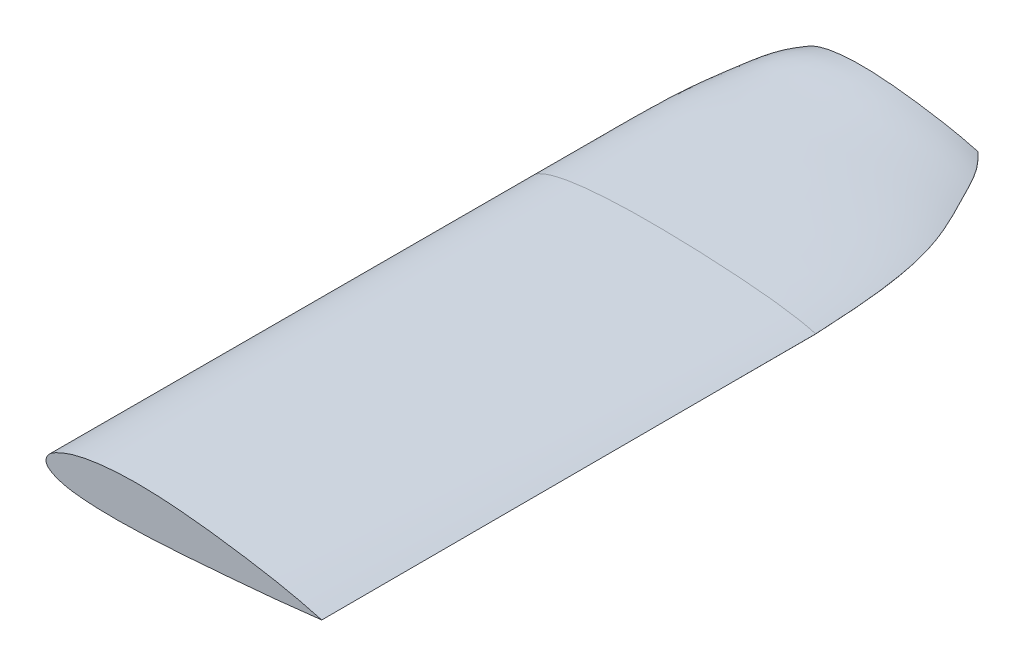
ISO-10303-21;
HEADER;
FILE_DESCRIPTION(('STEP AP214'),'2;1');
FILE_NAME('part.step','',(''),(''),'','','');
FILE_SCHEMA(('AUTOMOTIVE_DESIGN { 1 0 10303 214 1 1 1 1 }'));
ENDSEC;
DATA;
#1=APPLICATION_CONTEXT('core data for automotive mechanical design processes');
#2=APPLICATION_PROTOCOL_DEFINITION('international standard','automotive_design',2000,#1);
#3=PRODUCT_CONTEXT('',#1,'mechanical');
#4=PRODUCT('Part','Part','',(#3));
#5=PRODUCT_RELATED_PRODUCT_CATEGORY('part','',(#4));
#6=PRODUCT_DEFINITION_FORMATION('','',#4);
#7=PRODUCT_DEFINITION_CONTEXT('part definition',#1,'design');
#8=PRODUCT_DEFINITION('design','',#6,#7);
#9=PRODUCT_DEFINITION_SHAPE('','',#8);
#10=(LENGTH_UNIT() NAMED_UNIT(*) SI_UNIT(.MILLI.,.METRE.));
#11=(NAMED_UNIT(*) PLANE_ANGLE_UNIT() SI_UNIT($,.RADIAN.));
#12=(NAMED_UNIT(*) SI_UNIT($,.STERADIAN.) SOLID_ANGLE_UNIT());
#13=UNCERTAINTY_MEASURE_WITH_UNIT(LENGTH_MEASURE(1.E-05),#10,'distance_accuracy_value','');
#14=(GEOMETRIC_REPRESENTATION_CONTEXT(3) GLOBAL_UNCERTAINTY_ASSIGNED_CONTEXT((#13)) GLOBAL_UNIT_ASSIGNED_CONTEXT((#10,
#11,#12)) REPRESENTATION_CONTEXT('',''));
#15=CARTESIAN_POINT('',(0.,0.,0.));
#16=DIRECTION('',(0.,0.,1.));
#17=DIRECTION('',(1.,0.,0.));
#18=AXIS2_PLACEMENT_3D('',#15,#16,#17);
#19=CARTESIAN_POINT('',(-112.706859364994,1.77768741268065,-729.));
#20=DIRECTION('',(0.,0.,-1.));
#21=DIRECTION('',(-1.,0.,0.));
#22=AXIS2_PLACEMENT_3D('',#19,#20,#21);
#23=PLANE('',#22);
#24=CARTESIAN_POINT('',(60.0000380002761,-6.61419723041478E-09,-729.));
#25=CARTESIAN_POINT('',(59.8767145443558,0.0345440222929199,-729.));
#26=CARTESIAN_POINT('',(42.9479281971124,4.77645204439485,-729.));
#27=CARTESIAN_POINT('',(12.1873138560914,10.3562532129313,-729.));
#28=CARTESIAN_POINT('',(-27.6903099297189,15.4093511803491,-729.));
#29=CARTESIAN_POINT('',(-56.982211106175,16.7120559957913,-729.));
#30=CARTESIAN_POINT('',(-75.0721644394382,15.6150904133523,-729.));
#31=CARTESIAN_POINT('',(-86.9112483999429,13.9239385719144,-729.));
#32=CARTESIAN_POINT('',(-96.6362019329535,11.8477062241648,-729.));
#33=CARTESIAN_POINT('',(-105.256657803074,8.67211311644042,-729.));
#34=CARTESIAN_POINT('',(-111.598741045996,4.59144234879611,-729.));
#35=CARTESIAN_POINT('',(-114.730741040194,-2.30460425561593,-729.));
#36=CARTESIAN_POINT('',(-104.455195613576,-7.11188785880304,-729.));
#37=CARTESIAN_POINT('',(-90.0310116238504,-9.51772411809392,-729.));
#38=CARTESIAN_POINT('',(-66.7634655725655,-10.1699481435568,-729.));
#39=CARTESIAN_POINT('',(-38.5338401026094,-8.94360667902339,-729.));
#40=CARTESIAN_POINT('',(-14.7625214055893,-7.23464150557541,-729.));
#41=CARTESIAN_POINT('',(11.4625371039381,-4.98219612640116,-729.));
#42=CARTESIAN_POINT('',(34.6425461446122,-2.99848358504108,-729.));
#43=CARTESIAN_POINT('',(53.5220055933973,-0.770446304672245,-729.));
#44=CARTESIAN_POINT('',(59.8150416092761,-0.0277810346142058,-729.));
#45=B_SPLINE_CURVE_WITH_KNOTS('',3,(#24,#25,#26,#27,#28,#29,#30,#31,#32,#33,#34,#35,#36,#37,#38,
#39,#40,#41,#42,#43,#44),.UNSPECIFIED.,.F.,.F.,(4,1,1,1,1,1,1,1,1,1,1,1,1,1,1,1,1,1,4),(0.,
0.00108174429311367,0.148492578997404,0.263251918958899,0.340569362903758,0.39574871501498,
0.416041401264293,0.441514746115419,0.479770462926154,0.492552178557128,0.505235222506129,
0.534441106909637,0.562494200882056,0.638711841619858,0.724063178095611,0.803562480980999,
0.839429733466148,0.946477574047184,1.),.UNSPECIFIED.);
#46=CARTESIAN_POINT('',(60.0000380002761,-6.61419722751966E-09,-729.));
#47=VERTEX_POINT('',#46);
#48=CARTESIAN_POINT('',(59.8150166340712,0.0518148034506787,-729.));
#49=VERTEX_POINT('',#48);
#50=EDGE_CURVE('E179',#47,#49,#45,.T.);
#51=ORIENTED_EDGE('',*,*,#50,.F.);
#52=DIRECTION('',(0.98891158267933,0.148505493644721,0.));
#53=VECTOR('',#52,1.);
#54=CARTESIAN_POINT('',(59.8150416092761,-0.0277810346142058,-729.));
#55=LINE('',#54,#53);
#56=CARTESIAN_POINT('',(59.8150416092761,-0.0277810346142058,-729.));
#57=VERTEX_POINT('',#56);
#58=EDGE_CURVE('E174',#57,#47,#55,.T.);
#59=ORIENTED_EDGE('',*,*,#58,.F.);
#60=CARTESIAN_POINT('',(-112.706859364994,1.77768741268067,-729.));
#61=VERTEX_POINT('',#60);
#62=EDGE_CURVE('E178',#61,#57,#45,.T.);
#63=ORIENTED_EDGE('',*,*,#62,.F.);
#64=EDGE_CURVE('E197',#49,#61,#45,.T.);
#65=ORIENTED_EDGE('',*,*,#64,.F.);
#66=EDGE_LOOP('',(#51,#59,#63,#65));
#67=FACE_BOUND('',#66,.T.);
#68=ADVANCED_FACE('F116',(#67),#23,.T.);
#69=CARTESIAN_POINT('',(-136.535719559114,2.81552743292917,0.));
#70=DIRECTION('',(0.,0.,-1.));
#71=DIRECTION('',(-1.,0.,0.));
#72=AXIS2_PLACEMENT_3D('',#69,#70,#71);
#73=PLANE('',#72);
#74=CARTESIAN_POINT('',(137.,0.,0.));
#75=CARTESIAN_POINT('',(136.8046785,0.0547113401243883,0.));
#76=CARTESIAN_POINT('',(109.992618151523,7.56501488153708,0.));
#77=CARTESIAN_POINT('',(61.2735055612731,16.402385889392,0.));
#78=CARTESIAN_POINT('',(-1.88526043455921,24.4055566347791,0.));
#79=CARTESIAN_POINT('',(-48.2782035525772,26.4687996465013,0.));
#80=CARTESIAN_POINT('',(-76.9293372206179,24.7314094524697,0.));
#81=CARTESIAN_POINT('',(-95.6802522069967,22.0529383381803,0.));
#82=CARTESIAN_POINT('',(-111.082776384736,18.7645710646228,0.));
#83=CARTESIAN_POINT('',(-124.735980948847,13.735020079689,0.));
#84=CARTESIAN_POINT('',(-134.780665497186,7.27199380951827,0.));
#85=CARTESIAN_POINT('',(-139.741173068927,-3.65006604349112,0.));
#86=CARTESIAN_POINT('',(-123.466613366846,-11.2639123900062,0.));
#87=CARTESIAN_POINT('',(-100.621379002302,-15.0743111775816,0.));
#88=CARTESIAN_POINT('',(-63.7698979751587,-16.1073131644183,0.));
#89=CARTESIAN_POINT('',(-19.0594027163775,-14.1650155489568,0.));
#90=CARTESIAN_POINT('',(18.5899608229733,-11.458331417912,0.));
#91=CARTESIAN_POINT('',(60.1255935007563,-7.89087535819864,0.));
#92=CARTESIAN_POINT('',(96.8384321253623,-4.74904231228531,0.));
#93=CARTESIAN_POINT('',(126.739997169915,-1.22024415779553,0.));
#94=CARTESIAN_POINT('',(136.707,-0.0440000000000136,0.));
#95=B_SPLINE_CURVE_WITH_KNOTS('',3,(#74,#75,#76,#77,#78,#79,#80,#81,#82,#83,#84,#85,#86,#87,#88,
#89,#90,#91,#92,#93,#94),.UNSPECIFIED.,.F.,.F.,(4,1,1,1,1,1,1,1,1,1,1,1,1,1,1,1,1,1,4),(0.,
0.00108174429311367,0.148492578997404,0.263251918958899,0.340569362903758,0.39574871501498,
0.416041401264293,0.441514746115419,0.479770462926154,0.492552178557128,0.505235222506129,
0.534441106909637,0.562494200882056,0.638711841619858,0.724063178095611,0.803562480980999,
0.839429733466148,0.946477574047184,1.),.UNSPECIFIED.);
#96=CARTESIAN_POINT('',(137.,0.,0.));
#97=VERTEX_POINT('',#96);
#98=CARTESIAN_POINT('',(-136.535719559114,2.81552743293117,0.));
#99=VERTEX_POINT('',#98);
#100=EDGE_CURVE('E128',#97,#99,#95,.T.);
#101=ORIENTED_EDGE('',*,*,#100,.T.);
#102=CARTESIAN_POINT('',(135.703530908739,-0.162419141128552,0.));
#103=VERTEX_POINT('',#102);
#104=EDGE_CURVE('E139',#99,#103,#95,.T.);
#105=ORIENTED_EDGE('',*,*,#104,.T.);
#106=CARTESIAN_POINT('',(136.707,-0.0440000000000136,0.));
#107=VERTEX_POINT('',#106);
#108=EDGE_CURVE('E205',#103,#107,#95,.T.);
#109=ORIENTED_EDGE('',*,*,#108,.T.);
#110=DIRECTION('',(0.988911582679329,0.14850549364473,0.));
#111=VECTOR('',#110,1.);
#112=CARTESIAN_POINT('',(136.707,-0.0440000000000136,0.));
#113=LINE('',#112,#111);
#114=EDGE_CURVE('E13',#107,#97,#113,.T.);
#115=ORIENTED_EDGE('',*,*,#114,.T.);
#116=EDGE_LOOP('',(#101,#105,#109,#115));
#117=FACE_BOUND('',#116,.T.);
#118=ADVANCED_FACE('F118',(#117),#73,.F.);
#119=CARTESIAN_POINT('',(136.16658456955,-0.103716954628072,-491.651334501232));
#120=CARTESIAN_POINT('',(134.754359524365,-0.104700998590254,-518.499153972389));
#121=CARTESIAN_POINT('',(133.050985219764,-0.105887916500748,-550.882013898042));
#122=CARTESIAN_POINT('',(127.794736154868,-0.117031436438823,-583.057738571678));
#123=CARTESIAN_POINT('',(126.446398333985,-0.119346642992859,-590.251109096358));
#124=CARTESIAN_POINT('',(123.516225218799,-0.124065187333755,-605.273691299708));
#125=CARTESIAN_POINT('',(119.001167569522,-0.127049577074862,-622.167975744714));
#126=CARTESIAN_POINT('',(107.308726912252,-0.110417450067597,-652.556221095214));
#127=CARTESIAN_POINT('',(97.8999682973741,-0.0919941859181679,-670.523166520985));
#128=CARTESIAN_POINT('',(84.0691722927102,-0.148516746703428,-697.239212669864));
#129=CARTESIAN_POINT('',(77.9415043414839,-0.202340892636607,-709.318757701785));
#130=CARTESIAN_POINT('',(67.0047056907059,-0.0977606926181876,-722.133865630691));
#131=CARTESIAN_POINT('',(63.3078195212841,-0.0461650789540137,-725.757637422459));
#132=CARTESIAN_POINT('',(60.0000380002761,-6.61419722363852E-09,-729.));
#133=CARTESIAN_POINT('',(136.128084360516,-0.108609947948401,-491.651358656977));
#134=CARTESIAN_POINT('',(134.718322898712,-0.109321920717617,-518.499179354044));
#135=CARTESIAN_POINT('',(133.017920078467,-0.110180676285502,-550.882040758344));
#136=CARTESIAN_POINT('',(127.764633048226,-0.120996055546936,-583.057766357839));
#137=CARTESIAN_POINT('',(126.416959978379,-0.123237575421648,-590.251137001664));
#138=CARTESIAN_POINT('',(123.488176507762,-0.127802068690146,-605.273719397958));
#139=CARTESIAN_POINT('',(118.974703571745,-0.13061037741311,-622.168003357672));
#140=CARTESIAN_POINT('',(107.285224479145,-0.113647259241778,-652.556244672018));
#141=CARTESIAN_POINT('',(97.8782920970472,-0.095018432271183,-670.523185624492));
#142=CARTESIAN_POINT('',(84.0501826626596,-0.151240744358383,-697.239225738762));
#143=CARTESIAN_POINT('',(77.9237171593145,-0.204930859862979,-709.318768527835));
#144=CARTESIAN_POINT('',(66.9884237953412,-0.100177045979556,-722.13387001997));
#145=CARTESIAN_POINT('',(63.2919944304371,-0.0485279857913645,-725.757639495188));
#146=CARTESIAN_POINT('',(59.9846216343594,-0.00231509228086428,-729.));
#147=CARTESIAN_POINT('',(136.051040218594,-0.118395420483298,-491.651400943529));
#148=CARTESIAN_POINT('',(134.646204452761,-0.118563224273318,-518.499223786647));
#149=CARTESIAN_POINT('',(132.951742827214,-0.118765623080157,-550.882087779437));
#150=CARTESIAN_POINT('',(127.704380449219,-0.128924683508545,-583.057814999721));
#151=CARTESIAN_POINT('',(126.358037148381,-0.131018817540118,-590.251185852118));
#152=CARTESIAN_POINT('',(123.432033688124,-0.135275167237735,-605.273768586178));
#153=CARTESIAN_POINT('',(118.921731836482,-0.137731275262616,-622.168051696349));
#154=CARTESIAN_POINT('',(107.238182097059,-0.1201062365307,-652.556285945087));
#155=CARTESIAN_POINT('',(97.8349083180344,-0.101066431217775,-670.5232190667));
#156=CARTESIAN_POINT('',(84.0121819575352,-0.156687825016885,-697.239248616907));
#157=CARTESIAN_POINT('',(77.8881261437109,-0.210109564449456,-709.318787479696));
#158=CARTESIAN_POINT('',(66.9558533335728,-0.105009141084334,-722.133877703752));
#159=CARTESIAN_POINT('',(63.2603410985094,-0.0532535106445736,-725.757643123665));
#160=CARTESIAN_POINT('',(59.9537889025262,-0.00694526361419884,-729.));
#161=CARTESIAN_POINT('',(135.93534266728,-0.133071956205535,-491.651446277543));
#162=CARTESIAN_POINT('',(134.53789102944,-0.132423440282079,-518.499271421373));
#163=CARTESIAN_POINT('',(132.852335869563,-0.131641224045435,-550.882138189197));
#164=CARTESIAN_POINT('',(127.613862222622,-0.140815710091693,-583.057867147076));
#165=CARTESIAN_POINT('',(126.26951437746,-0.142688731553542,-590.251238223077));
#166=CARTESIAN_POINT('',(123.347683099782,-0.146482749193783,-605.273821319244));
#167=CARTESIAN_POINT('',(118.842142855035,-0.148410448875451,-622.168103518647));
#168=CARTESIAN_POINT('',(107.167505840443,-0.129792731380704,-652.55633019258));
#169=CARTESIAN_POINT('',(97.769738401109,-0.110136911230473,-670.523254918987));
#170=CARTESIAN_POINT('',(83.9551164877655,-0.164855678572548,-697.23927314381));
#171=CARTESIAN_POINT('',(77.8346896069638,-0.217873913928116,-709.318807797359));
#172=CARTESIAN_POINT('',(66.9069776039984,-0.112255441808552,-722.133885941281));
#173=CARTESIAN_POINT('',(63.2128516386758,-0.0603409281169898,-725.757647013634));
#174=CARTESIAN_POINT('',(59.907539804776,-0.0138905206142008,-729.));
#175=CARTESIAN_POINT('',(135.819513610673,-0.147746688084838,-491.651473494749));
#176=CARTESIAN_POINT('',(134.429441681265,-0.146281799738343,-518.499300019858));
#177=CARTESIAN_POINT('',(132.752787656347,-0.144514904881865,-550.882168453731));
#178=CARTESIAN_POINT('',(127.523204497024,-0.152704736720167,-583.057898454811));
#179=CARTESIAN_POINT('',(126.180852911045,-0.154356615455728,-590.251269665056));
#180=CARTESIAN_POINT('',(123.263195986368,-0.157688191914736,-605.273852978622));
#181=CARTESIAN_POINT('',(118.762422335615,-0.159087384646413,-622.168134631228));
#182=CARTESIAN_POINT('',(107.096716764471,-0.139477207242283,-652.556356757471));
#183=CARTESIAN_POINT('',(97.7044741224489,-0.119205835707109,-670.523276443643));
#184=CARTESIAN_POINT('',(83.8979865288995,-0.173020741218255,-697.23928786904));
#185=CARTESIAN_POINT('',(77.7812029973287,-0.225634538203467,-709.318819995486));
#186=CARTESIAN_POINT('',(66.8580818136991,-0.119499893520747,-722.13389088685));
#187=CARTESIAN_POINT('',(63.1653527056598,-0.0674274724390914,-725.757649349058));
#188=CARTESIAN_POINT('',(59.8612907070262,-0.0208357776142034,-729.));
#189=CARTESIAN_POINT('',(135.742206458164,-0.157528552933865,-491.651479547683));
#190=CARTESIAN_POINT('',(134.357051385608,-0.155519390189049,-518.49930637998));
#191=CARTESIAN_POINT('',(132.686327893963,-0.153096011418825,-550.882175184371));
#192=CARTESIAN_POINT('',(127.462672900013,-0.160629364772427,-583.057905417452));
#193=CARTESIAN_POINT('',(126.121652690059,-0.162133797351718,-590.251276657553));
#194=CARTESIAN_POINT('',(123.206780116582,-0.165157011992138,-605.273860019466));
#195=CARTESIAN_POINT('',(118.709187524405,-0.166203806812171,-622.168141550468));
#196=CARTESIAN_POINT('',(107.049448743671,-0.145932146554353,-652.556362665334));
#197=CARTESIAN_POINT('',(97.6609016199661,-0.125250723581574,-670.52328123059));
#198=CARTESIAN_POINT('',(83.8598568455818,-0.178462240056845,-697.239291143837));
#199=CARTESIAN_POINT('',(77.7455118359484,-0.230805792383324,-709.318822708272));
#200=CARTESIAN_POINT('',(66.8254712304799,-0.124328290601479,-722.133891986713));
#201=CARTESIAN_POINT('',(63.1336804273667,-0.0721512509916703,-725.757649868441));
#202=CARTESIAN_POINT('',(59.8304579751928,-0.0254659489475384,-729.));
#203=CARTESIAN_POINT('',(135.703530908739,-0.162419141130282,-491.651479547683));
#204=CARTESIAN_POINT('',(134.320833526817,-0.160137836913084,-518.49930637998));
#205=CARTESIAN_POINT('',(132.653074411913,-0.157386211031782,-550.882175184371));
#206=CARTESIAN_POINT('',(127.432383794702,-0.164591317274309,-583.057905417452));
#207=CARTESIAN_POINT('',(126.092029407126,-0.16602202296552,-590.251276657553));
#208=CARTESIAN_POINT('',(123.178549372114,-0.168891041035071,-605.273860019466));
#209=CARTESIAN_POINT('',(118.682548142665,-0.169761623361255,-622.168141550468));
#210=CARTESIAN_POINT('',(107.025795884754,-0.149159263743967,-652.556362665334));
#211=CARTESIAN_POINT('',(97.6390996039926,-0.128272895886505,-670.52328123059));
#212=CARTESIAN_POINT('',(83.840781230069,-0.181182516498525,-697.239291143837));
#213=CARTESIAN_POINT('',(77.727657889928,-0.233390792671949,-709.318822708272));
#214=CARTESIAN_POINT('',(66.8091625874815,-0.126742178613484,-722.133891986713));
#215=CARTESIAN_POINT('',(63.1178427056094,-0.0745129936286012,-725.757649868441));
#216=CARTESIAN_POINT('',(59.8150416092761,-0.0277810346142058,-729.));
#217=B_SPLINE_SURFACE_WITH_KNOTS('',3,3,((#119,#120,#121,#122,#123,#124,#125,#126,#127,#128,
#129,#130,#131,#132),(#133,#134,#135,#136,#137,#138,#139,#140,#141,#142,#143,#144,#145,#146),
(#147,#148,#149,#150,#151,#152,#153,#154,#155,#156,#157,#158,#159,#160),(#161,#162,#163,#164,
#165,#166,#167,#168,#169,#170,#171,#172,#173,#174),(#175,#176,#177,#178,#179,#180,#181,#182,
#183,#184,#185,#186,#187,#188),(#189,#190,#191,#192,#193,#194,#195,#196,#197,#198,#199,#200,
#201,#202),(#203,#204,#205,#206,#207,#208,#209,#210,#211,#212,#213,#214,#215,#216)),
.UNSPECIFIED.,.F.,.F.,.F.,(4,1,1,1,4),(4,1,2,1,1,1,1,1,1,1,4),(0.9976874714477,
0.998265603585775,0.99884373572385,0.999421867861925,1.),(0.658986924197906,0.767086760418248,
0.789373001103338,0.796372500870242,0.850622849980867,0.859367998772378,0.927732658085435,
0.932030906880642,0.979286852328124,0.981466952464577,1.),.UNSPECIFIED.);
#218=CARTESIAN_POINT('',(136.16658456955,-0.103716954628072,-491.651334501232));
#219=CARTESIAN_POINT('',(136.128084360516,-0.108609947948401,-491.651358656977));
#220=CARTESIAN_POINT('',(136.051040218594,-0.118395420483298,-491.651400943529));
#221=CARTESIAN_POINT('',(135.93534266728,-0.133071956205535,-491.651446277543));
#222=CARTESIAN_POINT('',(135.819513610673,-0.147746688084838,-491.651473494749));
#223=CARTESIAN_POINT('',(135.742206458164,-0.157528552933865,-491.651479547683));
#224=CARTESIAN_POINT('',(135.703530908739,-0.162419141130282,-491.651479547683));
#225=B_SPLINE_CURVE_WITH_KNOTS('',3,(#218,#219,#220,#221,#222,#223,#224),.UNSPECIFIED.,.F.,.F.,
(4,1,1,1,4),(0.9976874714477,0.998265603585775,0.99884373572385,0.999421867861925,1.),.UNSPECIFIED.);
#226=CARTESIAN_POINT('',(136.16658456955,-0.103716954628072,-491.651334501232));
#227=VERTEX_POINT('',#226);
#228=CARTESIAN_POINT('',(135.703530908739,-0.162419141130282,-491.651479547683));
#229=VERTEX_POINT('',#228);
#230=EDGE_CURVE('E204',#227,#229,#225,.T.);
#231=CARTESIAN_POINT('',(135.703530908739,-0.162419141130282,-491.651479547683));
#232=CARTESIAN_POINT('',(134.320833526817,-0.160137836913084,-518.49930637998));
#233=CARTESIAN_POINT('',(132.653074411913,-0.157386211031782,-550.882175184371));
#234=CARTESIAN_POINT('',(127.432383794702,-0.164591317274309,-583.057905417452));
#235=CARTESIAN_POINT('',(126.092029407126,-0.16602202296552,-590.251276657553));
#236=CARTESIAN_POINT('',(123.178549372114,-0.168891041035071,-605.273860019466));
#237=CARTESIAN_POINT('',(118.682548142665,-0.169761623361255,-622.168141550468));
#238=CARTESIAN_POINT('',(107.025795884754,-0.149159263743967,-652.556362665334));
#239=CARTESIAN_POINT('',(97.6390996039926,-0.128272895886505,-670.52328123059));
#240=CARTESIAN_POINT('',(83.840781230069,-0.181182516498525,-697.239291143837));
#241=CARTESIAN_POINT('',(77.727657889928,-0.233390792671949,-709.318822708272));
#242=CARTESIAN_POINT('',(66.8091625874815,-0.126742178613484,-722.133891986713));
#243=CARTESIAN_POINT('',(63.1178427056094,-0.0745129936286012,-725.757649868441));
#244=CARTESIAN_POINT('',(59.8150416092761,-0.0277810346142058,-729.));
#245=B_SPLINE_CURVE_WITH_KNOTS('',3,(#231,#232,#233,#234,#235,#236,#237,#238,#239,#240,#241,
#242,#243,#244),.UNSPECIFIED.,.F.,.F.,(4,1,2,1,1,1,1,1,1,1,4),(0.658986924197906,
0.767086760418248,0.789373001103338,0.796372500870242,0.850622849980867,0.859367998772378,
0.927732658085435,0.932030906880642,0.979286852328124,0.981466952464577,1.),.UNSPECIFIED.);
#246=EDGE_CURVE('E193',#229,#57,#245,.T.);
#247=CARTESIAN_POINT('',(136.16658456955,-0.103716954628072,-491.651334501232));
#248=CARTESIAN_POINT('',(134.754359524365,-0.104700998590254,-518.499153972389));
#249=CARTESIAN_POINT('',(133.050985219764,-0.105887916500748,-550.882013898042));
#250=CARTESIAN_POINT('',(127.794736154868,-0.117031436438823,-583.057738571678));
#251=CARTESIAN_POINT('',(126.446398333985,-0.119346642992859,-590.251109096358));
#252=CARTESIAN_POINT('',(123.516225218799,-0.124065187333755,-605.273691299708));
#253=CARTESIAN_POINT('',(119.001167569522,-0.127049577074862,-622.167975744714));
#254=CARTESIAN_POINT('',(107.308726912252,-0.110417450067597,-652.556221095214));
#255=CARTESIAN_POINT('',(97.8999682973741,-0.0919941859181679,-670.523166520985));
#256=CARTESIAN_POINT('',(84.0691722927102,-0.148516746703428,-697.239212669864));
#257=CARTESIAN_POINT('',(77.9415043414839,-0.202340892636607,-709.318757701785));
#258=CARTESIAN_POINT('',(67.0047056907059,-0.0977606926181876,-722.133865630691));
#259=CARTESIAN_POINT('',(63.3078195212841,-0.0461650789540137,-725.757637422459));
#260=CARTESIAN_POINT('',(60.0000380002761,-6.61419722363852E-09,-729.));
#261=B_SPLINE_CURVE_WITH_KNOTS('',3,(#247,#248,#249,#250,#251,#252,#253,#254,#255,#256,#257,
#258,#259,#260),.UNSPECIFIED.,.F.,.F.,(4,1,2,1,1,1,1,1,1,1,4),(0.658986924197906,
0.767086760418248,0.789373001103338,0.796372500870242,0.850622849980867,0.859367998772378,
0.927732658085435,0.932030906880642,0.979286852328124,0.981466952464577,1.),.UNSPECIFIED.);
#262=EDGE_CURVE('E209',#227,#47,#261,.T.);
#263=ORIENTED_EDGE('',*,*,#230,.T.);
#264=ORIENTED_EDGE('',*,*,#246,.T.);
#265=ORIENTED_EDGE('',*,*,#58,.T.);
#266=ORIENTED_EDGE('',*,*,#262,.F.);
#267=EDGE_LOOP('',(#263,#264,#265,#266));
#268=FACE_BOUND('',#267,.T.);
#269=ADVANCED_FACE('F202',(#268),#217,.T.);
#270=CARTESIAN_POINT('',(136.707,-0.0440000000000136,0.));
#271=CARTESIAN_POINT('',(136.526861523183,-0.0639056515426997,-163.883778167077));
#272=CARTESIAN_POINT('',(136.346723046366,-0.0838113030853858,-327.767556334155));
#273=CARTESIAN_POINT('',(136.16658456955,-0.103716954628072,-491.651334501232));
#274=CARTESIAN_POINT('',(136.623377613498,-0.0538685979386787,0.));
#275=CARTESIAN_POINT('',(136.458279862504,-0.072115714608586,-163.883786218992));
#276=CARTESIAN_POINT('',(136.29318211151,-0.0903628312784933,-327.767572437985));
#277=CARTESIAN_POINT('',(136.128084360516,-0.108609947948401,-491.651358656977));
#278=CARTESIAN_POINT('',(136.456132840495,-0.0736057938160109,0.));
#279=CARTESIAN_POINT('',(136.321101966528,-0.0885356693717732,-163.88380031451));
#280=CARTESIAN_POINT('',(136.18607109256,-0.103465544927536,-327.767600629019));
#281=CARTESIAN_POINT('',(136.051040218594,-0.118395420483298,-491.651400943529));
#282=CARTESIAN_POINT('',(136.205265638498,-0.103211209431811,0.));
#283=CARTESIAN_POINT('',(136.115291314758,-0.113164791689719,-163.883815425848));
#284=CARTESIAN_POINT('',(136.025316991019,-0.123118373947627,-327.767630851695));
#285=CARTESIAN_POINT('',(135.93534266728,-0.133071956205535,-491.651446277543));
#286=CARTESIAN_POINT('',(135.954398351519,-0.132815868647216,0.));
#287=CARTESIAN_POINT('',(135.909436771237,-0.137792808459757,-163.88382449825));
#288=CARTESIAN_POINT('',(135.864475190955,-0.142769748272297,-327.7676489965));
#289=CARTESIAN_POINT('',(135.819513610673,-0.147746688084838,-491.651473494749));
#290=CARTESIAN_POINT('',(135.787153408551,-0.152551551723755,0.));
#291=CARTESIAN_POINT('',(135.772171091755,-0.154210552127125,-163.883826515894));
#292=CARTESIAN_POINT('',(135.757188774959,-0.155869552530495,-327.767653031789));
#293=CARTESIAN_POINT('',(135.742206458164,-0.157528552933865,-491.651479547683));
#294=CARTESIAN_POINT('',(135.703530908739,-0.162419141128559,0.));
#295=CARTESIAN_POINT('',(135.703530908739,-0.162419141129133,-163.883826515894));
#296=CARTESIAN_POINT('',(135.703530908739,-0.162419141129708,-327.767653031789));
#297=CARTESIAN_POINT('',(135.703530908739,-0.162419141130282,-491.651479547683));
#298=B_SPLINE_SURFACE_WITH_KNOTS('',3,3,((#270,#271,#272,#273),(#274,#275,#276,#277),(#278,#279,
#280,#281),(#282,#283,#284,#285),(#286,#287,#288,#289),(#290,#291,#292,#293),(#294,#295,#296,
#297)),.UNSPECIFIED.,.F.,.F.,.F.,(4,1,1,1,4),(4,4),(0.9976874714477,0.998265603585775,
0.99884373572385,0.999421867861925,1.),(0.,0.658986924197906),.UNSPECIFIED.);
#299=DIRECTION('',(0.,0.,-1.));
#300=VECTOR('',#299,1.);
#301=CARTESIAN_POINT('',(135.703530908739,-0.16241914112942,-245.825739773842));
#302=LINE('',#301,#300);
#303=EDGE_CURVE('E206',#103,#229,#302,.T.);
#304=DIRECTION('',(-0.00109918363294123,-0.000121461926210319,-0.999999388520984));
#305=VECTOR('',#304,1.);
#306=CARTESIAN_POINT('',(136.436792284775,-0.0738584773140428,-245.825667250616));
#307=LINE('',#306,#305);
#308=EDGE_CURVE('E452',#107,#227,#307,.T.);
#309=ORIENTED_EDGE('',*,*,#108,.F.);
#310=ORIENTED_EDGE('',*,*,#303,.T.);
#311=ORIENTED_EDGE('',*,*,#230,.F.);
#312=ORIENTED_EDGE('',*,*,#308,.F.);
#313=EDGE_LOOP('',(#309,#310,#311,#312));
#314=FACE_BOUND('',#313,.T.);
#315=ADVANCED_FACE('F245',(#314),#298,.T.);
#316=CARTESIAN_POINT('',(136.143386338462,-0.054553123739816,-491.651170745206));
#317=CARTESIAN_POINT('',(134.713896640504,-0.0552548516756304,-518.498981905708));
#318=CARTESIAN_POINT('',(132.989698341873,-0.056101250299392,-550.881831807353));
#319=CARTESIAN_POINT('',(127.712689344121,-0.0669041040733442,-583.057550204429));
#320=CARTESIAN_POINT('',(126.359692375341,-0.0691426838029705,-590.250919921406));
#321=CARTESIAN_POINT('',(123.419779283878,-0.0737005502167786,-605.273500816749));
#322=CARTESIAN_POINT('',(118.893613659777,-0.0765015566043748,-622.167788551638));
#323=CARTESIAN_POINT('',(107.1804111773,-0.0595289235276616,-652.556061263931));
#324=CARTESIAN_POINT('',(97.758847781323,-0.0408976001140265,-670.523037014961));
#325=CARTESIAN_POINT('',(83.9092138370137,-0.0970963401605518,-697.239124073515));
#326=CARTESIAN_POINT('',(77.7731141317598,-0.150771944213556,-709.318684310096));
#327=CARTESIAN_POINT('',(66.8257565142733,-0.0460314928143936,-722.133835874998));
#328=CARTESIAN_POINT('',(63.1256655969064,0.00560930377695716,-725.757623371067));
#329=CARTESIAN_POINT('',(59.8150166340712,0.0518148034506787,-729.));
#330=CARTESIAN_POINT('',(136.145338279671,-0.0586491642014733,-491.651186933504));
#331=CARTESIAN_POINT('',(134.71728794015,-0.0593743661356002,-518.498998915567));
#332=CARTESIAN_POINT('',(132.994825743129,-0.0602490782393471,-550.881849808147));
#333=CARTESIAN_POINT('',(127.719546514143,-0.0710802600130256,-583.0575688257));
#334=CARTESIAN_POINT('',(126.366937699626,-0.0733252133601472,-590.250938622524));
#335=CARTESIAN_POINT('',(123.427835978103,-0.0778964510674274,-605.273519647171));
#336=CARTESIAN_POINT('',(118.902595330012,-0.0807127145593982,-622.167807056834));
#337=CARTESIAN_POINT('',(107.191120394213,-0.0637683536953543,-652.556077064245));
#338=CARTESIAN_POINT('',(97.7706214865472,-0.0451542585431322,-670.523049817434));
#339=CARTESIAN_POINT('',(83.9225531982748,-0.10138009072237,-697.239132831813));
#340=CARTESIAN_POINT('',(77.7871541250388,-0.15506817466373,-709.318691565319));
#341=CARTESIAN_POINT('',(66.840672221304,-0.0503407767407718,-722.133838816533));
#342=CARTESIAN_POINT('',(63.1408468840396,0.00129640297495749,-725.757624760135));
#343=CARTESIAN_POINT('',(59.8304355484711,0.0474986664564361,-729.));
#344=CARTESIAN_POINT('',(136.14923271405,-0.0668420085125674,-491.651218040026));
#345=CARTESIAN_POINT('',(134.724060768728,-0.0676142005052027,-518.499031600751));
#346=CARTESIAN_POINT('',(133.005070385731,-0.0685455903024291,-550.881884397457));
#347=CARTESIAN_POINT('',(127.733250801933,-0.0794334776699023,-583.057604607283));
#348=CARTESIAN_POINT('',(126.381418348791,-0.0816911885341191,-590.250974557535));
#349=CARTESIAN_POINT('',(123.443939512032,-0.0862891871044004,-605.273555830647));
#350=CARTESIAN_POINT('',(118.920549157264,-0.0891359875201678,-622.167842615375));
#351=CARTESIAN_POINT('',(107.212530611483,-0.0722482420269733,-652.556107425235));
#352=CARTESIAN_POINT('',(97.7941619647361,-0.0536686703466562,-670.523074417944));
#353=CARTESIAN_POINT('',(83.9492270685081,-0.109948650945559,-697.239149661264));
#354=CARTESIAN_POINT('',(77.8152302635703,-0.16366165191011,-709.318705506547));
#355=CARTESIAN_POINT('',(66.8705018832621,-0.0589605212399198,-722.133844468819));
#356=CARTESIAN_POINT('',(63.1712084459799,-0.0073306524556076,-725.757627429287));
#357=CARTESIAN_POINT('',(59.8612730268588,0.0388650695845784,-728.999999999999));
#358=CARTESIAN_POINT('',(136.155046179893,-0.0791329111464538,-491.651260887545));
#359=CARTESIAN_POINT('',(134.734190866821,-0.0799756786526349,-518.499076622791));
#360=CARTESIAN_POINT('',(133.020407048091,-0.0809921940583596,-550.881932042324));
#361=CARTESIAN_POINT('',(127.753777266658,-0.0919652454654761,-583.057653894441));
#362=CARTESIAN_POINT('',(126.403109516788,-0.0942421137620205,-590.251024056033));
#363=CARTESIAN_POINT('',(123.468065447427,-0.098880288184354,-605.273605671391));
#364=CARTESIAN_POINT('',(118.947451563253,-0.101772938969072,-622.167891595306));
#365=CARTESIAN_POINT('',(107.244621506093,-0.0849702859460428,-652.556149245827));
#366=CARTESIAN_POINT('',(97.8294521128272,-0.0664426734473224,-670.523108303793));
#367=CARTESIAN_POINT('',(83.989223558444,-0.122803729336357,-697.239172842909));
#368=CARTESIAN_POINT('',(77.8573331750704,-0.176553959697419,-709.318724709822));
#369=CARTESIAN_POINT('',(66.9152413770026,-0.0718926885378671,-722.133852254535));
#370=CARTESIAN_POINT('',(63.2167480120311,-0.0202740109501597,-725.7576311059));
#371=CARTESIAN_POINT('',(59.907528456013,0.0259116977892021,-729.000000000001));
#372=CARTESIAN_POINT('',(136.160831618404,-0.0914247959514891,-491.651299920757));
#373=CARTESIAN_POINT('',(134.744291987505,-0.0923381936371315,-518.499117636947));
#374=CARTESIAN_POINT('',(133.035713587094,-0.0934399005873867,-550.881975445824));
#375=CARTESIAN_POINT('',(127.774273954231,-0.104498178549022,-583.057698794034));
#376=CARTESIAN_POINT('',(126.424771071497,-0.106794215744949,-590.251069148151));
#377=CARTESIAN_POINT('',(123.492162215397,-0.111472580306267,-605.273651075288));
#378=CARTESIAN_POINT('',(118.974325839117,-0.114411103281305,-622.167936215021));
#379=CARTESIAN_POINT('',(107.276688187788,-0.0976936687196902,-652.55618734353));
#380=CARTESIAN_POINT('',(97.864721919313,-0.0792181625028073,-670.523139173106));
#381=CARTESIAN_POINT('',(84.0292059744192,-0.135660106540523,-697.23919396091));
#382=CARTESIAN_POINT('',(77.8994250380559,-0.189447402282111,-709.31874220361));
#383=CARTESIAN_POINT('',(66.9599761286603,-0.0848264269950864,-722.13385934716));
#384=CARTESIAN_POINT('',(63.2622850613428,-0.0332191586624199,-725.757634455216));
#385=CARTESIAN_POINT('',(59.9537833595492,0.0129563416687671,-728.999999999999));
#386=CARTESIAN_POINT('',(136.164669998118,-0.0996196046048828,-491.651323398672));
#387=CARTESIAN_POINT('',(134.751006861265,-0.100580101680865,-518.499142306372));
#388=CARTESIAN_POINT('',(133.045897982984,-0.101738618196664,-550.882001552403));
#389=CARTESIAN_POINT('',(127.787918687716,-0.112853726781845,-583.057725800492));
#390=CARTESIAN_POINT('',(126.439192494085,-0.115162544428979,-590.25109627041));
#391=CARTESIAN_POINT('',(123.508207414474,-0.11986769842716,-605.273678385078));
#392=CARTESIAN_POINT('',(118.99222340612,-0.122836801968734,-622.167963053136));
#393=CARTESIAN_POINT('',(107.298049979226,-0.106176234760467,-652.556210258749));
#394=CARTESIAN_POINT('',(97.8882217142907,-0.0877355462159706,-670.523157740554));
#395=CARTESIAN_POINT('',(84.0558516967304,-0.144231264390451,-697.239206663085));
#396=CARTESIAN_POINT('',(77.9274790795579,-0.198043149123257,-709.318752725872));
#397=CARTESIAN_POINT('',(66.9897963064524,-0.0934493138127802,-722.133863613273));
#398=CARTESIAN_POINT('',(63.2926415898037,-0.0418497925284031,-725.757636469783));
#399=CARTESIAN_POINT('',(59.9846197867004,0.00431877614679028,-729.));
#400=CARTESIAN_POINT('',(136.16658456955,-0.103716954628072,-491.651334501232));
#401=CARTESIAN_POINT('',(134.754359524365,-0.104700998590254,-518.499153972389));
#402=CARTESIAN_POINT('',(133.050985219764,-0.105887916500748,-550.882013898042));
#403=CARTESIAN_POINT('',(127.794736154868,-0.117031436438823,-583.057738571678));
#404=CARTESIAN_POINT('',(126.446398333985,-0.119346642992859,-590.251109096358));
#405=CARTESIAN_POINT('',(123.516225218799,-0.124065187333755,-605.273691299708));
#406=CARTESIAN_POINT('',(119.001167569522,-0.127049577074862,-622.167975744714));
#407=CARTESIAN_POINT('',(107.308726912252,-0.110417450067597,-652.556221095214));
#408=CARTESIAN_POINT('',(97.8999682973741,-0.0919941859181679,-670.523166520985));
#409=CARTESIAN_POINT('',(84.0691722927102,-0.148516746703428,-697.239212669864));
#410=CARTESIAN_POINT('',(77.9415043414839,-0.202340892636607,-709.318757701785));
#411=CARTESIAN_POINT('',(67.0047056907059,-0.0977606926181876,-722.133865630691));
#412=CARTESIAN_POINT('',(63.3078195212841,-0.0461650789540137,-725.757637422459));
#413=CARTESIAN_POINT('',(60.0000380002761,-6.61419722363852E-09,-729.));
#414=B_SPLINE_SURFACE_WITH_KNOTS('',3,3,((#316,#317,#318,#319,#320,#321,#322,#323,#324,#325,
#326,#327,#328,#329),(#330,#331,#332,#333,#334,#335,#336,#337,#338,#339,#340,#341,#342,#343),
(#344,#345,#346,#347,#348,#349,#350,#351,#352,#353,#354,#355,#356,#357),(#358,#359,#360,#361,
#362,#363,#364,#365,#366,#367,#368,#369,#370,#371),(#372,#373,#374,#375,#376,#377,#378,#379,
#380,#381,#382,#383,#384,#385),(#386,#387,#388,#389,#390,#391,#392,#393,#394,#395,#396,#397,
#398,#399),(#400,#401,#402,#403,#404,#405,#406,#407,#408,#409,#410,#411,#412,#413)),
.UNSPECIFIED.,.F.,.F.,.F.,(4,1,1,1,4),(4,1,2,1,1,1,1,1,1,1,4),(0.996624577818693,
0.996890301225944,0.997156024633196,0.997421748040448,0.9976874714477),(0.658986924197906,
0.767086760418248,0.789373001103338,0.796372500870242,0.850622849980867,0.859367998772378,
0.927732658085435,0.932030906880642,0.979286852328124,0.981466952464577,1.),.UNSPECIFIED.);
#415=CARTESIAN_POINT('',(136.143386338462,-0.054553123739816,-491.651170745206));
#416=CARTESIAN_POINT('',(136.145338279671,-0.0586491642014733,-491.651186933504));
#417=CARTESIAN_POINT('',(136.14923271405,-0.0668420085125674,-491.651218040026));
#418=CARTESIAN_POINT('',(136.155046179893,-0.0791329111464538,-491.651260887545));
#419=CARTESIAN_POINT('',(136.160831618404,-0.0914247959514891,-491.651299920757));
#420=CARTESIAN_POINT('',(136.164669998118,-0.0996196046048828,-491.651323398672));
#421=CARTESIAN_POINT('',(136.16658456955,-0.103716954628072,-491.651334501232));
#422=B_SPLINE_CURVE_WITH_KNOTS('',3,(#415,#416,#417,#418,#419,#420,#421),.UNSPECIFIED.,.F.,.F.,
(4,1,1,1,4),(0.996624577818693,0.996890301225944,0.997156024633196,0.997421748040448,
0.9976874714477),.UNSPECIFIED.);
#423=CARTESIAN_POINT('',(136.143386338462,-0.054553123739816,-491.651170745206));
#424=VERTEX_POINT('',#423);
#425=EDGE_CURVE('E419',#424,#227,#422,.T.);
#426=CARTESIAN_POINT('',(136.143386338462,-0.054553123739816,-491.651170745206));
#427=CARTESIAN_POINT('',(134.713896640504,-0.0552548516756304,-518.498981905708));
#428=CARTESIAN_POINT('',(132.989698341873,-0.056101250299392,-550.881831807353));
#429=CARTESIAN_POINT('',(127.712689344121,-0.0669041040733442,-583.057550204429));
#430=CARTESIAN_POINT('',(126.359692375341,-0.0691426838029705,-590.250919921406));
#431=CARTESIAN_POINT('',(123.419779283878,-0.0737005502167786,-605.273500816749));
#432=CARTESIAN_POINT('',(118.893613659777,-0.0765015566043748,-622.167788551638));
#433=CARTESIAN_POINT('',(107.1804111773,-0.0595289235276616,-652.556061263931));
#434=CARTESIAN_POINT('',(97.758847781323,-0.0408976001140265,-670.523037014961));
#435=CARTESIAN_POINT('',(83.9092138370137,-0.0970963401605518,-697.239124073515));
#436=CARTESIAN_POINT('',(77.7731141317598,-0.150771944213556,-709.318684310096));
#437=CARTESIAN_POINT('',(66.8257565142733,-0.0460314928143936,-722.133835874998));
#438=CARTESIAN_POINT('',(63.1256655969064,0.00560930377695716,-725.757623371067));
#439=CARTESIAN_POINT('',(59.8150166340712,0.0518148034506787,-729.));
#440=B_SPLINE_CURVE_WITH_KNOTS('',3,(#426,#427,#428,#429,#430,#431,#432,#433,#434,#435,#436,
#437,#438,#439),.UNSPECIFIED.,.F.,.F.,(4,1,2,1,1,1,1,1,1,1,4),(0.658986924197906,
0.767086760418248,0.789373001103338,0.796372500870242,0.850622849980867,0.859367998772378,
0.927732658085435,0.932030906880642,0.979286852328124,0.981466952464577,1.),.UNSPECIFIED.);
#441=EDGE_CURVE('E231',#424,#49,#440,.T.);
#442=ORIENTED_EDGE('',*,*,#425,.T.);
#443=ORIENTED_EDGE('',*,*,#262,.T.);
#444=ORIENTED_EDGE('',*,*,#50,.T.);
#445=ORIENTED_EDGE('',*,*,#441,.F.);
#446=EDGE_LOOP('',(#442,#443,#444,#445));
#447=FACE_BOUND('',#446,.T.);
#448=ADVANCED_FACE('F232',(#447),#414,.T.);
#449=CARTESIAN_POINT('',(137.,0.,0.));
#450=CARTESIAN_POINT('',(136.714462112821,-0.0181843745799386,-163.883723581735));
#451=CARTESIAN_POINT('',(136.428924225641,-0.0363687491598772,-327.76744716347));
#452=CARTESIAN_POINT('',(136.143386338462,-0.054553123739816,-491.651170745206));
#453=CARTESIAN_POINT('',(136.975583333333,-0.00366666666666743,0.));
#454=CARTESIAN_POINT('',(136.698834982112,-0.021994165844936,-163.883728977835));
#455=CARTESIAN_POINT('',(136.422086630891,-0.0403216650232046,-327.76745795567));
#456=CARTESIAN_POINT('',(136.145338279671,-0.0586491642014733,-491.651186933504));
#457=CARTESIAN_POINT('',(136.92675,-0.0110000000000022,0.));
#458=CARTESIAN_POINT('',(136.66757757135,-0.0296140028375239,-163.883739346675));
#459=CARTESIAN_POINT('',(136.4084051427,-0.0482280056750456,-327.76747869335));
#460=CARTESIAN_POINT('',(136.14923271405,-0.0668420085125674,-491.651218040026));
#461=CARTESIAN_POINT('',(136.8535,-0.0220000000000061,0.));
#462=CARTESIAN_POINT('',(136.620682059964,-0.0410443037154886,-163.883753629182));
#463=CARTESIAN_POINT('',(136.387864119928,-0.0600886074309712,-327.767507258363));
#464=CARTESIAN_POINT('',(136.155046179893,-0.0791329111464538,-491.651260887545));
#465=CARTESIAN_POINT('',(136.78025,-0.0330000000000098,0.));
#466=CARTESIAN_POINT('',(136.573777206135,-0.0524749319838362,-163.883766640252));
#467=CARTESIAN_POINT('',(136.367304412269,-0.0719498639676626,-327.767533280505));
#468=CARTESIAN_POINT('',(136.160831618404,-0.0914247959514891,-491.651299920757));
#469=CARTESIAN_POINT('',(136.731416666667,-0.0403333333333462,0.));
#470=CARTESIAN_POINT('',(136.542501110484,-0.0600954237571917,-163.883774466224));
#471=CARTESIAN_POINT('',(136.3535855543,-0.0798575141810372,-327.767548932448));
#472=CARTESIAN_POINT('',(136.164669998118,-0.0996196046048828,-491.651323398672));
#473=CARTESIAN_POINT('',(136.707,-0.0440000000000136,0.));
#474=CARTESIAN_POINT('',(136.526861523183,-0.0639056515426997,-163.883778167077));
#475=CARTESIAN_POINT('',(136.346723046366,-0.0838113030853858,-327.767556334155));
#476=CARTESIAN_POINT('',(136.16658456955,-0.103716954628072,-491.651334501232));
#477=B_SPLINE_SURFACE_WITH_KNOTS('',3,3,((#449,#450,#451,#452),(#453,#454,#455,#456),(#457,#458,
#459,#460),(#461,#462,#463,#464),(#465,#466,#467,#468),(#469,#470,#471,#472),(#473,#474,#475,
#476)),.UNSPECIFIED.,.F.,.F.,.F.,(4,1,1,1,4),(4,4),(0.996624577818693,0.996890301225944,
0.997156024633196,0.997421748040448,0.9976874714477),(0.,0.658986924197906),.UNSPECIFIED.);
#478=DIRECTION('',(-0.00174231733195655,-0.000110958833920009,-0.999998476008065));
#479=VECTOR('',#478,1.);
#480=CARTESIAN_POINT('',(136.571693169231,-0.0272765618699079,-245.825585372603));
#481=LINE('',#480,#479);
#482=EDGE_CURVE('E443',#97,#424,#481,.T.);
#483=ORIENTED_EDGE('',*,*,#114,.F.);
#484=ORIENTED_EDGE('',*,*,#308,.T.);
#485=ORIENTED_EDGE('',*,*,#425,.F.);
#486=ORIENTED_EDGE('',*,*,#482,.F.);
#487=EDGE_LOOP('',(#483,#484,#485,#486));
#488=FACE_BOUND('',#487,.T.);
#489=ADVANCED_FACE('F244',(#488),#477,.T.);
#490=CARTESIAN_POINT('',(-136.535719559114,2.8155274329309,-482.596620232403));
#491=CARTESIAN_POINT('',(-136.535719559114,2.81552743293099,-508.984910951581));
#492=CARTESIAN_POINT('',(-136.535719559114,2.8155274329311,-540.813504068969));
#493=CARTESIAN_POINT('',(-136.5464001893,2.81369225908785,-572.642173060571));
#494=CARTESIAN_POINT('',(-136.51214067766,2.81957881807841,-579.790882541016));
#495=CARTESIAN_POINT('',(-136.305811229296,2.85503088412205,-594.741139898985));
#496=CARTESIAN_POINT('',(-135.983657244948,2.88490911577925,-611.817334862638));
#497=CARTESIAN_POINT('',(-133.920328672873,2.76134227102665,-643.718521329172));
#498=CARTESIAN_POINT('',(-131.377046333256,2.52903558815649,-663.362269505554));
#499=CARTESIAN_POINT('',(-126.260592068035,3.06181562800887,-692.340372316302));
#500=CARTESIAN_POINT('',(-123.383112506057,3.46234190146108,-705.260642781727));
#501=CARTESIAN_POINT('',(-117.04312877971,2.61326319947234,-720.488556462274));
#502=CARTESIAN_POINT('',(-114.754555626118,2.17226746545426,-724.980680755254));
#503=CARTESIAN_POINT('',(-112.706859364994,1.77768741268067,-729.));
#504=CARTESIAN_POINT('',(-136.355044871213,3.34027125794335,-482.596620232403));
#505=CARTESIAN_POINT('',(-136.358240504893,3.33098999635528,-508.984910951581));
#506=CARTESIAN_POINT('',(-136.3620949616,3.3197952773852,-540.813504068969));
#507=CARTESIAN_POINT('',(-136.376630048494,3.30676538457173,-572.642173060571));
#508=CARTESIAN_POINT('',(-136.343236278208,3.31013752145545,-579.790882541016));
#509=CARTESIAN_POINT('',(-136.138717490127,3.34033078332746,-594.741139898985));
#510=CARTESIAN_POINT('',(-135.818632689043,3.36419936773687,-611.817334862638));
#511=CARTESIAN_POINT('',(-133.759187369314,3.22935417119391,-643.718521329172));
#512=CARTESIAN_POINT('',(-131.218311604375,2.99005793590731,-663.362269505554));
#513=CARTESIAN_POINT('',(-126.105402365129,3.51254195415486,-692.340372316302));
#514=CARTESIAN_POINT('',(-123.229511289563,3.90845469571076,-705.260642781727));
#515=CARTESIAN_POINT('',(-116.891536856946,3.05354028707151,-720.488556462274));
#516=CARTESIAN_POINT('',(-114.603576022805,2.61076615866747,-724.980680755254));
#517=CARTESIAN_POINT('',(-112.556427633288,2.21459489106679,-729.));
#518=CARTESIAN_POINT('',(-135.87538429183,4.34995335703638,-482.597718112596));
#519=CARTESIAN_POINT('',(-135.886667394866,4.32281078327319,-508.986064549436));
#520=CARTESIAN_POINT('',(-135.900276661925,4.29007240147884,-540.814724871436));
#521=CARTESIAN_POINT('',(-135.924996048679,4.25549786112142,-572.643435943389));
#522=CARTESIAN_POINT('',(-135.893914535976,4.25403015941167,-579.792150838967));
#523=CARTESIAN_POINT('',(-135.694261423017,4.27409831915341,-594.742416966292));
#524=CARTESIAN_POINT('',(-135.379888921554,4.2863977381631,-611.818589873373));
#525=CARTESIAN_POINT('',(-133.331731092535,4.1298650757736,-643.71959289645));
#526=CARTESIAN_POINT('',(-130.798266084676,3.87714829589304,-663.363137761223));
#527=CARTESIAN_POINT('',(-125.696435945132,4.37974682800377,-692.340966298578));
#528=CARTESIAN_POINT('',(-122.825571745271,4.76672603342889,-705.261134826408));
#529=CARTESIAN_POINT('',(-116.494669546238,3.90069681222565,-720.4887559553));
#530=CARTESIAN_POINT('',(-114.208951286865,3.4545600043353,-724.980774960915));
#531=CARTESIAN_POINT('',(-112.163809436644,3.05537998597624,-729.000000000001));
#532=CARTESIAN_POINT('',(-134.893649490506,5.72649124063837,-482.602607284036));
#533=CARTESIAN_POINT('',(-134.920520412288,5.67501574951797,-508.991201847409));
#534=CARTESIAN_POINT('',(-134.952931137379,5.61292789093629,-540.820161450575));
#535=CARTESIAN_POINT('',(-134.998364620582,5.54899948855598,-572.649059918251));
#536=CARTESIAN_POINT('',(-134.972046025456,5.54093537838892,-579.797798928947));
#537=CARTESIAN_POINT('',(-134.782486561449,5.54719500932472,-594.748104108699));
#538=CARTESIAN_POINT('',(-134.480325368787,5.54372138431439,-611.824178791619));
#539=CARTESIAN_POINT('',(-132.457610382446,5.35769633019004,-643.724364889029));
#540=CARTESIAN_POINT('',(-129.941763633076,5.08679064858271,-663.367004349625));
#541=CARTESIAN_POINT('',(-124.866610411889,5.56207823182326,-692.343611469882));
#542=CARTESIAN_POINT('',(-122.007977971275,5.93671695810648,-705.263326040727));
#543=CARTESIAN_POINT('',(-115.695726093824,5.05590338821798,-720.489644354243));
#544=CARTESIAN_POINT('',(-113.416080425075,4.60537019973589,-724.981194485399));
#545=CARTESIAN_POINT('',(-111.376372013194,4.2022565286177,-728.999999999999));
#546=CARTESIAN_POINT('',(-133.666865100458,6.92028113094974,-482.610687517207));
#547=CARTESIAN_POINT('',(-133.712487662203,6.84771834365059,-508.9996921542));
#548=CARTESIAN_POINT('',(-133.767515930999,6.76019575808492,-540.8291463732));
#549=CARTESIAN_POINT('',(-133.838727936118,6.67082538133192,-572.658354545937));
#550=CARTESIAN_POINT('',(-133.818381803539,6.65704134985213,-579.807133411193));
#551=CARTESIAN_POINT('',(-133.641531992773,6.65131747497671,-594.757503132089));
#552=CARTESIAN_POINT('',(-133.355013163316,6.63416099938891,-611.833415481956));
#553=CARTESIAN_POINT('',(-131.36582863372,6.42263737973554,-643.732251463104));
#554=CARTESIAN_POINT('',(-128.873820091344,6.136075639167,-663.373394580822));
#555=CARTESIAN_POINT('',(-123.834978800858,6.58744545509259,-692.34798309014));
#556=CARTESIAN_POINT('',(-120.993076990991,6.95119708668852,-705.266947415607));
#557=CARTESIAN_POINT('',(-114.707240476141,6.05797619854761,-720.491112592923));
#558=CARTESIAN_POINT('',(-112.436287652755,5.60384219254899,-724.981887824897));
#559=CARTESIAN_POINT('',(-110.404357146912,5.19750669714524,-729.000000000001));
#560=CARTESIAN_POINT('',(-132.258420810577,7.9301180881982,-482.621907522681));
#561=CARTESIAN_POINT('',(-132.324823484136,7.83972338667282,-509.011481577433));
#562=CARTESIAN_POINT('',(-132.404915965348,7.73069259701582,-540.841622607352));
#563=CARTESIAN_POINT('',(-132.505581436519,7.61980395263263,-572.671260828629));
#564=CARTESIAN_POINT('',(-132.492104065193,7.60117917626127,-579.820095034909));
#565=CARTESIAN_POINT('',(-132.329923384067,7.5853025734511,-594.770554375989));
#566=CARTESIAN_POINT('',(-132.061720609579,7.55655994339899,-611.846241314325));
#567=CARTESIAN_POINT('',(-130.112706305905,7.32354264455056,-643.743202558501));
#568=CARTESIAN_POINT('',(-127.649839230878,7.02386361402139,-663.382267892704));
#569=CARTESIAN_POINT('',(-122.655586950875,7.45472300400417,-692.354053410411));
#570=CARTESIAN_POINT('',(-119.834303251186,7.80904834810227,-705.271975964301));
#571=CARTESIAN_POINT('',(-113.581840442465,6.90579790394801,-720.493151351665));
#572=CARTESIAN_POINT('',(-111.321950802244,6.44885772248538,-724.98285057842));
#573=CARTESIAN_POINT('',(-109.299919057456,6.04001140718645,-729.));
#574=CARTESIAN_POINT('',(-130.736182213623,8.8025275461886,-482.636216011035));
#575=CARTESIAN_POINT('',(-130.824197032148,8.69668869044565,-509.026516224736));
#576=CARTESIAN_POINT('',(-130.930357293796,8.5690297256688,-540.857533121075));
#577=CARTESIAN_POINT('',(-131.0626880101,8.43950007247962,-572.687719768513));
#578=CARTESIAN_POINT('',(-131.05664590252,8.41667872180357,-579.836624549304));
#579=CARTESIAN_POINT('',(-130.910402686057,8.39198879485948,-594.787198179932));
#580=CARTESIAN_POINT('',(-130.662392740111,8.35319510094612,-611.862597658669));
#581=CARTESIAN_POINT('',(-128.758666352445,8.10163389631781,-643.757168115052));
#582=CARTESIAN_POINT('',(-126.329281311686,7.79072152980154,-663.393583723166));
#583=CARTESIAN_POINT('',(-121.386469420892,8.20351868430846,-692.36179468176));
#584=CARTESIAN_POINT('',(-118.589049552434,8.54944984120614,-705.27838870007));
#585=CARTESIAN_POINT('',(-112.376073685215,7.63799666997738,-720.495751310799));
#586=CARTESIAN_POINT('',(-110.129355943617,7.1788759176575,-724.984078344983));
#587=CARTESIAN_POINT('',(-108.119109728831,6.76807854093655,-728.999999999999));
#588=CARTESIAN_POINT('',(-129.154759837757,9.60980908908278,-482.653561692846));
#589=CARTESIAN_POINT('',(-129.264279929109,9.48963927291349,-509.044742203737));
#590=CARTESIAN_POINT('',(-129.396379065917,9.34469482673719,-540.876820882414));
#591=CARTESIAN_POINT('',(-129.561434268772,9.19786413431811,-572.707672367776));
#592=CARTESIAN_POINT('',(-129.563133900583,9.17114512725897,-579.856662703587));
#593=CARTESIAN_POINT('',(-129.433551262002,9.13825932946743,-594.807374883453));
#594=CARTESIAN_POINT('',(-129.206980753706,9.09012455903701,-611.882425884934));
#595=CARTESIAN_POINT('',(-127.352450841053,8.8214196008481,-643.77409807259));
#596=CARTESIAN_POINT('',(-124.960119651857,8.50019657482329,-663.407301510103));
#597=CARTESIAN_POINT('',(-120.074459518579,8.89596909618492,-692.371179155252));
#598=CARTESIAN_POINT('',(-117.303635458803,9.23390717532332,-705.286162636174));
#599=CARTESIAN_POINT('',(-111.13557658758,8.31527130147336,-720.498903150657));
#600=CARTESIAN_POINT('',(-108.903927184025,7.85434857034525,-724.985566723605));
#601=CARTESIAN_POINT('',(-106.907163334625,7.44193887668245,-729.000000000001));
#602=CARTESIAN_POINT('',(-127.528582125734,10.3738460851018,-482.673893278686));
#603=CARTESIAN_POINT('',(-127.659284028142,10.2400962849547,-509.066105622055));
#604=CARTESIAN_POINT('',(-127.816931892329,10.0787721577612,-540.899428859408));
#605=CARTESIAN_POINT('',(-128.015489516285,9.91554354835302,-572.731059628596));
#606=CARTESIAN_POINT('',(-128.025173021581,9.88512771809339,-579.880150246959));
#607=CARTESIAN_POINT('',(-127.912838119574,9.84445849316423,-594.831024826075));
#608=CARTESIAN_POINT('',(-127.708791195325,9.78745827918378,-611.905667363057));
#609=CARTESIAN_POINT('',(-125.907034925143,9.50256876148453,-643.793942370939));
#610=CARTESIAN_POINT('',(-123.555104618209,9.17168354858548,-663.423380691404));
#611=CARTESIAN_POINT('',(-118.731968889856,9.55107055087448,-692.382179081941));
#612=CARTESIAN_POINT('',(-115.990317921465,9.88123918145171,-705.295274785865));
#613=CARTESIAN_POINT('',(-109.872377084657,8.95620747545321,-720.50259755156));
#614=CARTESIAN_POINT('',(-107.657618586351,8.4937891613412,-724.987311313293));
#615=CARTESIAN_POINT('',(-105.675967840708,8.08004129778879,-728.999999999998));
#616=CARTESIAN_POINT('',(-125.857062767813,11.0894151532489,-482.697159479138));
#617=CARTESIAN_POINT('',(-126.00865094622,10.9429329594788,-509.090552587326));
#618=CARTESIAN_POINT('',(-126.191491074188,10.7662514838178,-540.925300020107));
#619=CARTESIAN_POINT('',(-126.42434267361,10.5876446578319,-572.757822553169));
#620=CARTESIAN_POINT('',(-126.442254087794,10.5537590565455,-579.907027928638));
#621=CARTESIAN_POINT('',(-126.347756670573,10.505773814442,-594.85808834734));
#622=CARTESIAN_POINT('',(-126.167313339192,10.4404465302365,-611.932263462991));
#623=CARTESIAN_POINT('',(-124.421873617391,10.1404482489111,-643.816650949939));
#624=CARTESIAN_POINT('',(-122.113650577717,9.80062065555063,-663.44178070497));
#625=CARTESIAN_POINT('',(-117.358344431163,10.1643717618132,-692.394766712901));
#626=CARTESIAN_POINT('',(-114.648410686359,10.4870451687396,-705.305702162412));
#627=CARTESIAN_POINT('',(-108.585713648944,9.5564598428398,-720.506825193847));
#628=CARTESIAN_POINT('',(-106.389641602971,9.0928680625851,-724.989307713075));
#629=CARTESIAN_POINT('',(-104.424710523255,8.67807024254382,-729.000000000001));
#630=CARTESIAN_POINT('',(-124.145102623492,11.7621149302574,-482.72330900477));
#631=CARTESIAN_POINT('',(-124.317213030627,11.6036426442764,-509.118029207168));
#632=CARTESIAN_POINT('',(-124.524806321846,11.4124991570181,-540.954377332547));
#633=CARTESIAN_POINT('',(-124.7926407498,11.2194068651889,-572.787902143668));
#634=CARTESIAN_POINT('',(-124.818999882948,11.1822500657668,-579.937236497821));
#635=CARTESIAN_POINT('',(-124.74287764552,11.127356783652,-594.888505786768));
#636=CARTESIAN_POINT('',(-124.587051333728,11.0541728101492,-611.96215555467));
#637=CARTESIAN_POINT('',(-122.901319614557,10.7400128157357,-643.84217374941));
#638=CARTESIAN_POINT('',(-120.639996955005,10.3918819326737,-663.462460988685));
#639=CARTESIAN_POINT('',(-115.957651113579,10.740633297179,-692.408914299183));
#640=CARTESIAN_POINT('',(-113.281897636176,11.056035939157,-705.317421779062));
#641=CARTESIAN_POINT('',(-107.279434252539,10.1206675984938,-720.511576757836));
#642=CARTESIAN_POINT('',(-105.103798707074,9.65620150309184,-724.991551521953));
#643=CARTESIAN_POINT('',(-103.157153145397,9.2406213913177,-728.999999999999));
#644=CARTESIAN_POINT('',(-122.394460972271,12.3922465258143,-482.752290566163));
#645=CARTESIAN_POINT('',(-122.586718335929,12.2225271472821,-509.148481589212));
#646=CARTESIAN_POINT('',(-122.818612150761,12.0178178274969,-540.986603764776));
#647=CARTESIAN_POINT('',(-123.122084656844,11.8111337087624,-572.821239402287));
#648=CARTESIAN_POINT('',(-123.157102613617,11.7709045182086,-579.970716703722));
#649=CARTESIAN_POINT('',(-123.099873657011,11.7095117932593,-594.9222174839));
#650=CARTESIAN_POINT('',(-122.969648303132,11.6289421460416,-611.995285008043));
#651=CARTESIAN_POINT('',(-121.346934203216,11.3015675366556,-643.87046070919));
#652=CARTESIAN_POINT('',(-119.135634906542,10.9457715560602,-663.485380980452));
#653=CARTESIAN_POINT('',(-114.531269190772,11.2801634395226,-692.424594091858));
#654=CARTESIAN_POINT('',(-111.892106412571,11.5885226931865,-705.330410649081));
#655=CARTESIAN_POINT('',(-105.954766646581,10.6491369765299,-720.516842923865));
#656=CARTESIAN_POINT('',(-103.80128312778,10.184093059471,-724.994038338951));
#657=CARTESIAN_POINT('',(-101.874458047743,9.76799594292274,-729.));
#658=CARTESIAN_POINT('',(-120.608196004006,12.9829630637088,-482.78405287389));
#659=CARTESIAN_POINT('',(-120.820187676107,12.8026732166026,-509.181855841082));
#660=CARTESIAN_POINT('',(-121.0758842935,12.5852141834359,-541.021922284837));
#661=CARTESIAN_POINT('',(-121.415584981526,12.3657518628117,-572.857775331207));
#662=CARTESIAN_POINT('',(-121.459457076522,12.3226311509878,-580.007409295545));
#663=CARTESIAN_POINT('',(-121.42160509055,12.2551101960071,-594.959163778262));
#664=CARTESIAN_POINT('',(-121.31791821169,12.1675830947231,-612.031593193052));
#665=CARTESIAN_POINT('',(-119.761417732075,11.8278595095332,-643.901461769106));
#666=CARTESIAN_POINT('',(-117.603174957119,11.4649852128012,-663.510500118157));
#667=CARTESIAN_POINT('',(-113.081669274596,11.7855875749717,-692.441778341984));
#668=CARTESIAN_POINT('',(-110.481442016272,12.0871003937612,-705.344645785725));
#669=CARTESIAN_POINT('',(-104.61399949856,11.1444157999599,-720.522614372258));
#670=CARTESIAN_POINT('',(-102.48434399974,10.6790750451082,-724.996763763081));
#671=CARTESIAN_POINT('',(-100.578838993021,10.2627123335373,-729.));
#672=CARTESIAN_POINT('',(-118.788341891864,13.5360711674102,-482.818544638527));
#673=CARTESIAN_POINT('',(-119.019641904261,13.3458712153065,-509.218098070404));
#674=CARTESIAN_POINT('',(-119.298627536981,13.1164589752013,-541.060275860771));
#675=CARTESIAN_POINT('',(-119.675110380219,12.8850125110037,-572.897450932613));
#676=CARTESIAN_POINT('',(-119.72802265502,12.8391767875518,-580.047255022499));
#677=CARTESIAN_POINT('',(-119.710010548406,12.765889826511,-594.999285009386));
#678=CARTESIAN_POINT('',(-119.633768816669,12.671823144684,-612.071021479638));
#679=CARTESIAN_POINT('',(-118.14659357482,12.3205956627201,-643.935126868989));
#680=CARTESIAN_POINT('',(-116.044368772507,11.9512161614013,-663.537777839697));
#681=CARTESIAN_POINT('',(-111.610489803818,12.2585842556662,-692.460439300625));
#682=CARTESIAN_POINT('',(-109.051489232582,12.5534420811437,-705.360104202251));
#683=CARTESIAN_POINT('',(-103.258616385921,11.6081614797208,-720.528881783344));
#684=CARTESIAN_POINT('',(-101.154429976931,11.1427989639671,-724.999723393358));
#685=CARTESIAN_POINT('',(-99.2717133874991,10.7264167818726,-729.));
#686=CARTESIAN_POINT('',(-116.937153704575,14.0540030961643,-482.855714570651));
#687=CARTESIAN_POINT('',(-117.187309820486,13.8544868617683,-509.257154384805));
#688=CARTESIAN_POINT('',(-117.489038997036,13.613837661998,-541.101607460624));
#689=CARTESIAN_POINT('',(-117.902806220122,13.3711208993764,-572.940207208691));
#690=CARTESIAN_POINT('',(-117.964931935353,13.3227286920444,-580.090194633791));
#691=CARTESIAN_POINT('',(-117.967194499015,13.2440004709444,-595.042521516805));
#692=CARTESIAN_POINT('',(-117.919265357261,13.1437691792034,-612.113511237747));
#693=CARTESIAN_POINT('',(-116.504426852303,12.7818012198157,-643.971405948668));
#694=CARTESIAN_POINT('',(-114.461100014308,12.4064380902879,-663.567173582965));
#695=CARTESIAN_POINT('',(-110.119486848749,12.7010566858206,-692.480549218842));
#696=CARTESIAN_POINT('',(-107.603944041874,12.989420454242,-705.376762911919));
#697=CARTESIAN_POINT('',(-101.890203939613,12.042199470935,-720.535635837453));
#698=CARTESIAN_POINT('',(-99.8130902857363,11.5770747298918,-725.002912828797));
#699=CARTESIAN_POINT('',(-97.9545969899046,11.1609052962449,-729.));
#700=CARTESIAN_POINT('',(-114.429510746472,14.7004449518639,-482.908776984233));
#701=CARTESIAN_POINT('',(-114.704196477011,14.4892828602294,-509.312909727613));
#702=CARTESIAN_POINT('',(-115.035512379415,14.234586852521,-541.160610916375));
#703=CARTESIAN_POINT('',(-115.499624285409,13.9777756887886,-573.00124447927));
#704=CARTESIAN_POINT('',(-115.574255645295,13.926181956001,-580.151493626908));
#705=CARTESIAN_POINT('',(-115.604108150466,13.840623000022,-595.104244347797));
#706=CARTESIAN_POINT('',(-115.595050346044,13.7326621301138,-612.174168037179));
#707=CARTESIAN_POINT('',(-114.28057444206,13.3573710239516,-644.023196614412));
#708=CARTESIAN_POINT('',(-112.319529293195,12.974711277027,-663.609137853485));
#709=CARTESIAN_POINT('',(-108.106981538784,13.2529636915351,-692.509257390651));
#710=CARTESIAN_POINT('',(-105.652290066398,13.5328788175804,-705.400544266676));
#711=CARTESIAN_POINT('',(-100.050015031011,12.5839276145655,-720.545277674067));
#712=CARTESIAN_POINT('',(-98.0110917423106,12.1194591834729,-725.007465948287));
#713=CARTESIAN_POINT('',(-96.1867691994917,11.7038769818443,-729.));
#714=CARTESIAN_POINT('',(-111.225858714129,15.4321545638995,-482.981543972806));
#715=CARTESIAN_POINT('',(-111.530012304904,15.2077311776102,-509.389369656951));
#716=CARTESIAN_POINT('',(-111.896871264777,14.9370398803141,-541.241525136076));
#717=CARTESIAN_POINT('',(-112.424992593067,14.664168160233,-573.084947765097));
#718=CARTESIAN_POINT('',(-112.515643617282,14.6089179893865,-580.235555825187));
#719=CARTESIAN_POINT('',(-112.580968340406,14.5155267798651,-595.18888777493));
#720=CARTESIAN_POINT('',(-112.62251605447,14.3987202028,-612.257349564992));
#721=CARTESIAN_POINT('',(-111.440603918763,14.0084506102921,-644.094219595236));
#722=CARTESIAN_POINT('',(-109.589254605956,13.6178249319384,-663.666685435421));
#723=CARTESIAN_POINT('',(-105.549073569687,13.8766390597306,-692.548626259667));
#724=CARTESIAN_POINT('',(-103.175757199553,14.1463148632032,-705.433156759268));
#725=CARTESIAN_POINT('',(-97.7237170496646,13.1966943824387,-720.558499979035));
#726=CARTESIAN_POINT('',(-95.7363668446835,12.733645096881,-725.013709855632));
#727=CARTESIAN_POINT('',(-93.9581892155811,12.3193326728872,-729.));
#728=CARTESIAN_POINT('',(-107.282032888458,16.201795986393,-483.07875639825));
#729=CARTESIAN_POINT('',(-107.619603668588,15.9633295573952,-509.49151563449));
#730=CARTESIAN_POINT('',(-108.026769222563,15.6757000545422,-541.34962178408));
#731=CARTESIAN_POINT('',(-108.633226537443,15.3858029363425,-573.196770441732));
#732=CARTESIAN_POINT('',(-108.743666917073,15.3266631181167,-580.34785798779));
#733=CARTESIAN_POINT('',(-108.853009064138,15.2248897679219,-595.301966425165));
#734=CARTESIAN_POINT('',(-108.958310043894,15.0986442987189,-612.368475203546));
#735=CARTESIAN_POINT('',(-107.946264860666,14.6928279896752,-644.189102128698));
#736=CARTESIAN_POINT('',(-106.23698180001,14.294326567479,-663.743565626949));
#737=CARTESIAN_POINT('',(-102.420471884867,14.5312471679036,-692.601220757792));
#738=CARTESIAN_POINT('',(-100.152910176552,14.7890697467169,-705.476725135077));
#739=CARTESIAN_POINT('',(-94.8978337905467,13.8408647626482,-720.576164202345));
#740=CARTESIAN_POINT('',(-92.9782420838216,13.3804152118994,-725.022051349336));
#741=CARTESIAN_POINT('',(-91.260691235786,12.9684288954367,-728.999999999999));
#742=CARTESIAN_POINT('',(-103.247468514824,16.8726453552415,-483.185450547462));
#743=CARTESIAN_POINT('',(-103.616507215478,16.6218172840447,-509.603624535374));
#744=CARTESIAN_POINT('',(-104.06162822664,16.3192776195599,-541.468261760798));
#745=CARTESIAN_POINT('',(-104.747779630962,16.0143746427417,-573.319499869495));
#746=CARTESIAN_POINT('',(-104.878528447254,15.9517923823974,-580.471113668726));
#747=CARTESIAN_POINT('',(-105.033230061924,15.8425480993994,-595.426074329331));
#748=CARTESIAN_POINT('',(-105.205129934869,15.7079187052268,-612.490439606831));
#749=CARTESIAN_POINT('',(-104.373190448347,15.288746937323,-644.293239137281));
#750=CARTESIAN_POINT('',(-102.815907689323,14.8838993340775,-663.827944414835));
#751=CARTESIAN_POINT('',(-99.2391067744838,15.1001756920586,-692.658945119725));
#752=CARTESIAN_POINT('',(-97.0850255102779,15.3465055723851,-705.524543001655));
#753=CARTESIAN_POINT('',(-92.0428489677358,14.4017725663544,-720.59555132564));
#754=CARTESIAN_POINT('',(-90.1966266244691,13.9447609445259,-725.031206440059));
#755=CARTESIAN_POINT('',(-88.5447228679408,13.5358507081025,-729.000000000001));
#756=CARTESIAN_POINT('',(-99.1303725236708,17.45658564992,-483.301216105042));
#757=CARTESIAN_POINT('',(-99.5289405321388,17.1948740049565,-509.725265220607));
#758=CARTESIAN_POINT('',(-100.009678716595,16.8792069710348,-541.596988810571));
#759=CARTESIAN_POINT('',(-100.776734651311,16.5610727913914,-573.452664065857));
#760=CARTESIAN_POINT('',(-100.928268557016,16.4954405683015,-580.604848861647));
#761=CARTESIAN_POINT('',(-101.129571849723,16.3795231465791,-595.560734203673));
#762=CARTESIAN_POINT('',(-101.370745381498,16.2374345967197,-612.622773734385));
#763=CARTESIAN_POINT('',(-100.728617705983,15.8068451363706,-644.406230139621));
#764=CARTESIAN_POINT('',(-99.3327839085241,15.3970163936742,-663.91949730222));
#765=CARTESIAN_POINT('',(-96.0109540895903,15.5936988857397,-692.72157735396));
#766=CARTESIAN_POINT('',(-93.9777080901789,15.8288160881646,-705.576426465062));
#767=CARTESIAN_POINT('',(-89.1636315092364,14.889440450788,-720.616586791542));
#768=CARTESIAN_POINT('',(-87.3961324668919,14.4366436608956,-725.041139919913));
#769=CARTESIAN_POINT('',(-85.8146662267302,14.0315046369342,-728.999999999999));
#770=CARTESIAN_POINT('',(-94.9377413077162,17.9648231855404,-483.425642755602));
#771=CARTESIAN_POINT('',(-95.3639290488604,17.6935075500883,-509.856006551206));
#772=CARTESIAN_POINT('',(-95.8779811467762,17.366256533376,-541.735346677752));
#773=CARTESIAN_POINT('',(-96.7270265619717,17.0364267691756,-573.595791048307));
#774=CARTESIAN_POINT('',(-96.8997847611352,16.9680836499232,-580.748589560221));
#775=CARTESIAN_POINT('',(-97.1488425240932,16.8461802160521,-595.705468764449));
#776=CARTESIAN_POINT('',(-97.4618055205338,16.6974302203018,-612.765008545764));
#777=CARTESIAN_POINT('',(-97.0186854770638,16.2571132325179,-644.527674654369));
#778=CARTESIAN_POINT('',(-95.7932777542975,15.8435075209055,-664.017899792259));
#779=CARTESIAN_POINT('',(-92.7409257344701,16.0214529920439,-692.788895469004));
#780=CARTESIAN_POINT('',(-90.8355079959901,16.2455594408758,-705.632191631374));
#781=CARTESIAN_POINT('',(-86.2640070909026,15.3132585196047,-720.639196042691));
#782=CARTESIAN_POINT('',(-84.5803318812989,14.8653931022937,-725.05181658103));
#783=CARTESIAN_POINT('',(-83.0738668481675,14.4646664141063,-729.000000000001));
#784=CARTESIAN_POINT('',(-90.6753321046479,18.4048883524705,-483.558320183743));
#785=CARTESIAN_POINT('',(-91.1272830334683,18.1251192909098,-509.995417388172));
#786=CARTESIAN_POINT('',(-91.6724097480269,17.7876720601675,-541.88287910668));
#787=CARTESIAN_POINT('',(-92.6044330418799,17.4475270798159,-573.748408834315));
#788=CARTESIAN_POINT('',(-92.7988237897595,17.3767775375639,-580.901861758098));
#789=CARTESIAN_POINT('',(-93.0967129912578,17.2495039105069,-595.859800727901));
#790=CARTESIAN_POINT('',(-93.4838378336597,17.0948080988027,-612.916675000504));
#791=CARTESIAN_POINT('',(-93.2484401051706,16.646290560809,-644.657172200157));
#792=CARTESIAN_POINT('',(-92.2019820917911,16.2300034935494,-664.122827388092));
#793=CARTESIAN_POINT('',(-89.4328857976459,16.3899523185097,-692.860677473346));
#794=CARTESIAN_POINT('',(-87.6619394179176,16.6032063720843,-705.691654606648));
#795=CARTESIAN_POINT('',(-83.346780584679,15.6795731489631,-720.663304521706));
#796=CARTESIAN_POINT('',(-81.751780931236,15.2373085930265,-725.063201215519));
#797=CARTESIAN_POINT('',(-80.3246581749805,14.8415932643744,-728.999999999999));
#798=CARTESIAN_POINT('',(-86.3485686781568,18.7858687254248,-483.698838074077));
#799=CARTESIAN_POINT('',(-86.824482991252,18.4986354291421,-510.143066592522));
#800=CARTESIAN_POINT('',(-87.3985134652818,18.1521851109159,-542.039129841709));
#801=CARTESIAN_POINT('',(-88.414410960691,17.8029110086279,-573.910045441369));
#802=CARTESIAN_POINT('',(-88.6308125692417,17.7300161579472,-581.064191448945));
#803=CARTESIAN_POINT('',(-88.9785364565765,17.5978985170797,-596.023252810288));
#804=CARTESIAN_POINT('',(-89.442054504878,17.4378694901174,-613.077304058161));
#805=CARTESIAN_POINT('',(-89.4226171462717,16.9824758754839,-644.794322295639));
#806=CARTESIAN_POINT('',(-88.5631817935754,16.5644701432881,-664.233955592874));
#807=CARTESIAN_POINT('',(-86.0903944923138,16.7070103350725,-692.936701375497));
#808=CARTESIAN_POINT('',(-84.460214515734,16.909510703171,-705.754631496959));
#809=CARTESIAN_POINT('',(-80.414457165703,15.9959934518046,-720.688837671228));
#810=CARTESIAN_POINT('',(-78.912736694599,15.5599459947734,-725.075258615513));
#811=CARTESIAN_POINT('',(-77.5690753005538,15.1697934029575,-729.));
#812=CARTESIAN_POINT('',(-81.9618993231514,19.1121069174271,-483.846786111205));
#813=CARTESIAN_POINT('',(-82.4600538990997,18.818332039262,-510.29852302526));
#814=CARTESIAN_POINT('',(-83.0609097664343,18.463991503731,-542.203642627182));
#815=CARTESIAN_POINT('',(-84.1615097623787,18.1066944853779,-574.080228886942));
#816=CARTESIAN_POINT('',(-84.4002760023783,18.03189777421,-581.235104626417));
#817=CARTESIAN_POINT('',(-84.7987754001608,17.8954263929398,-596.195347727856));
#818=CARTESIAN_POINT('',(-85.340789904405,17.730635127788,-613.246426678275));
#819=CARTESIAN_POINT('',(-85.5450985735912,17.2696026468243,-644.938724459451));
#820=CARTESIAN_POINT('',(-84.8803231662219,16.8507794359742,-664.350959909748));
#821=CARTESIAN_POINT('',(-82.7161955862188,16.9764518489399,-693.016745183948));
#822=CARTESIAN_POINT('',(-81.2327389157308,17.16828473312,-705.820938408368));
#823=CARTESIAN_POINT('',(-77.4687480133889,16.2662466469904,-720.715720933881));
#824=CARTESIAN_POINT('',(-76.0646660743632,15.8369974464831,-725.087953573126));
#825=CARTESIAN_POINT('',(-74.808366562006,15.4529275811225,-729.));
#826=CARTESIAN_POINT('',(-77.5192994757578,19.3850594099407,-484.001753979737));
#827=CARTESIAN_POINT('',(-78.0380535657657,19.0856430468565,-510.461355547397));
#828=CARTESIAN_POINT('',(-78.6637558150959,18.7244979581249,-542.375961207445));
#829=CARTESIAN_POINT('',(-79.8498254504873,18.3602573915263,-574.258487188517));
#830=CARTESIAN_POINT('',(-80.1112870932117,18.2837965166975,-581.414127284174));
#831=CARTESIAN_POINT('',(-80.5614436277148,18.143450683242,-596.375608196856));
#832=CARTESIAN_POINT('',(-81.1839334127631,17.9744550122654,-613.423573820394));
#833=CARTESIAN_POINT('',(-81.6193282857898,17.5089870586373,-645.089978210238));
#834=CARTESIAN_POINT('',(-81.1564187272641,17.0902191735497,-664.473515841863));
#835=CARTESIAN_POINT('',(-79.3126053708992,17.199566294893,-693.100586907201));
#836=CARTESIAN_POINT('',(-77.9814935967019,17.3808272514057,-705.890391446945));
#837=CARTESIAN_POINT('',(-74.5109432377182,16.4915740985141,-720.743879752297));
#838=CARTESIAN_POINT('',(-73.2086159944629,16.0696776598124,-725.101250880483));
#839=CARTESIAN_POINT('',(-72.0433612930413,15.692186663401,-729.));
#840=CARTESIAN_POINT('',(-73.0247794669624,19.6070484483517,-484.163331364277));
#841=CARTESIAN_POINT('',(-73.5625751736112,19.3028475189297,-510.631133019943));
#842=CARTESIAN_POINT('',(-74.2112447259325,18.9359314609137,-542.555629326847));
#843=CARTESIAN_POINT('',(-75.4834905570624,18.565775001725,-574.444348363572));
#844=CARTESIAN_POINT('',(-75.7679555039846,18.487876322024,-581.600785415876));
#845=CARTESIAN_POINT('',(-76.2705918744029,18.3441126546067,-596.563556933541));
#846=CARTESIAN_POINT('',(-76.9754116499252,18.1714439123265,-613.608276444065));
#847=CARTESIAN_POINT('',(-77.6487880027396,17.702685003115,-645.247683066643));
#848=CARTESIAN_POINT('',(-77.3945191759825,17.2848013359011,-664.601298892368));
#849=CARTESIAN_POINT('',(-75.8819788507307,17.3783444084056,-693.188004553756));
#850=CARTESIAN_POINT('',(-74.708498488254,17.5491280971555,-705.962806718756));
#851=CARTESIAN_POINT('',(-71.5423722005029,16.6738952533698,-720.773239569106));
#852=CARTESIAN_POINT('',(-70.3456727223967,16.2598754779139,-725.115115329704));
#853=CARTESIAN_POINT('',(-69.2749282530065,15.8894321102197,-729.));
#854=CARTESIAN_POINT('',(-66.9679552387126,19.8377792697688,-484.387033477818));
#855=CARTESIAN_POINT('',(-67.5291764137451,19.5283013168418,-510.866188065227));
#856=CARTESIAN_POINT('',(-68.2061009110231,19.1550203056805,-542.804377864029));
#857=CARTESIAN_POINT('',(-69.5941137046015,18.7782982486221,-574.701671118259));
#858=CARTESIAN_POINT('',(-69.9096306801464,18.6987739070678,-581.859211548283));
#859=CARTESIAN_POINT('',(-70.4832604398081,18.551041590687,-596.823769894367));
#860=CARTESIAN_POINT('',(-71.300163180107,18.3741598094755,-613.86399519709));
#861=CARTESIAN_POINT('',(-72.2994527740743,17.9024816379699,-645.46602370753));
#862=CARTESIAN_POINT('',(-72.3318326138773,17.4868366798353,-664.778213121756));
#863=CARTESIAN_POINT('',(-71.2746775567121,17.5599936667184,-693.309033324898));
#864=CARTESIAN_POINT('',(-70.317976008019,17.7169413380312,-706.063064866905));
#865=CARTESIAN_POINT('',(-67.5714745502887,16.8619664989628,-720.813887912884));
#866=CARTESIAN_POINT('',(-66.5204527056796,16.4591100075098,-725.134310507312));
#867=CARTESIAN_POINT('',(-65.5800530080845,16.098654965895,-729.));
#868=CARTESIAN_POINT('',(-59.2862133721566,20.0090776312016,-484.681133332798));
#869=CARTESIAN_POINT('',(-59.8732507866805,19.694975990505,-511.1752135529));
#870=CARTESIAN_POINT('',(-60.5813138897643,19.3161180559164,-543.131406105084));
#871=CARTESIAN_POINT('',(-62.1155168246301,18.9335552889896,-575.039971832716));
#872=CARTESIAN_POINT('',(-62.4705082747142,18.8525205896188,-582.198962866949));
#873=CARTESIAN_POINT('',(-63.1346503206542,18.7008818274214,-597.165870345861));
#874=CARTESIAN_POINT('',(-64.0956826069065,18.5199595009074,-614.200187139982));
#875=CARTESIAN_POINT('',(-65.5173955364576,18.0472552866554,-645.753074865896));
#876=CARTESIAN_POINT('',(-65.9228795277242,17.6362961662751,-665.010801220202));
#877=CARTESIAN_POINT('',(-65.4588911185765,17.6852186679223,-693.468149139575));
#878=CARTESIAN_POINT('',(-64.7847114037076,17.8251264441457,-706.194873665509));
#879=CARTESIAN_POINT('',(-62.5867563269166,16.9982396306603,-720.867328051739));
#880=CARTESIAN_POINT('',(-61.7263015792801,16.6105028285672,-725.15954629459));
#881=CARTESIAN_POINT('',(-60.9564114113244,16.2635760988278,-728.999999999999));
#882=CARTESIAN_POINT('',(-49.92011101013,20.0440649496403,-485.053926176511));
#883=CARTESIAN_POINT('',(-50.5332944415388,19.7272933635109,-511.56692571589));
#884=CARTESIAN_POINT('',(-51.2728939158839,19.3452150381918,-543.54593806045));
#885=CARTESIAN_POINT('',(-52.9844693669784,18.9590975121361,-575.468792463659));
#886=CARTESIAN_POINT('',(-53.387715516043,18.8770127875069,-582.629622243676));
#887=CARTESIAN_POINT('',(-54.1628613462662,18.7222303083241,-597.599507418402));
#888=CARTESIAN_POINT('',(-55.3023290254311,18.538252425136,-614.6263347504));
#889=CARTESIAN_POINT('',(-57.2515007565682,18.0681251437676,-646.116932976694));
#890=CARTESIAN_POINT('',(-58.1249675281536,17.665508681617,-665.305623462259));
#891=CARTESIAN_POINT('',(-58.4055636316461,17.6872520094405,-693.669839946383));
#892=CARTESIAN_POINT('',(-58.0862310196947,17.8071466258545,-706.361950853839));
#893=CARTESIAN_POINT('',(-56.5794622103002,17.0178697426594,-720.935067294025));
#894=CARTESIAN_POINT('',(-55.9593046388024,16.6499096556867,-725.191534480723));
#895=CARTESIAN_POINT('',(-55.4044198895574,16.3206781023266,-729.));
#896=CARTESIAN_POINT('',(-40.4338742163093,19.9243937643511,-485.443309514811));
#897=CARTESIAN_POINT('',(-41.0691054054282,19.6075647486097,-511.976070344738));
#898=CARTESIAN_POINT('',(-41.8352980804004,19.2254171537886,-543.978918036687));
#899=CARTESIAN_POINT('',(-43.725793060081,18.8388811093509,-575.916697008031));
#900=CARTESIAN_POINT('',(-44.1780158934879,18.756439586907,-583.079447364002));
#901=CARTESIAN_POINT('',(-45.0661241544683,18.5999210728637,-598.052442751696));
#902=CARTESIAN_POINT('',(-46.3885611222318,18.4145202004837,-615.071447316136));
#903=CARTESIAN_POINT('',(-48.882271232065,17.950403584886,-646.49698395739));
#904=CARTESIAN_POINT('',(-50.2405849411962,17.5585579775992,-665.613566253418));
#905=CARTESIAN_POINT('',(-51.2930648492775,17.5549425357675,-693.880506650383));
#906=CARTESIAN_POINT('',(-51.3417556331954,17.6552910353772,-706.536463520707));
#907=CARTESIAN_POINT('',(-50.5536246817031,16.9070152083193,-721.005821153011));
#908=CARTESIAN_POINT('',(-50.1834500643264,16.5602353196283,-725.224946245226));
#909=CARTESIAN_POINT('',(-49.8522370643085,16.2499547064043,-729.));
#910=CARTESIAN_POINT('',(-30.854304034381,19.6659347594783,-485.846000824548));
#911=CARTESIAN_POINT('',(-31.5082381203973,19.351398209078,-512.399198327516));
#912=CARTESIAN_POINT('',(-32.2969895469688,18.9720157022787,-544.426695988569));
#913=CARTESIAN_POINT('',(-34.3675756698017,18.5878835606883,-576.379909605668));
#914=CARTESIAN_POINT('',(-34.8693387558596,18.5057101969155,-583.544646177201));
#915=CARTESIAN_POINT('',(-35.8719480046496,18.34872888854,-598.520858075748));
#916=CARTESIAN_POINT('',(-37.3809538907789,18.1633792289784,-615.531772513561));
#917=CARTESIAN_POINT('',(-40.4328328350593,17.7083366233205,-646.890023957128));
#918=CARTESIAN_POINT('',(-42.2894776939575,17.3294011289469,-665.932033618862));
#919=CARTESIAN_POINT('',(-44.1356756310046,17.3021692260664,-694.098373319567));
#920=CARTESIAN_POINT('',(-44.5629305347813,17.3834726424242,-706.716940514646));
#921=CARTESIAN_POINT('',(-44.515421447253,16.6790779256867,-721.078993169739));
#922=CARTESIAN_POINT('',(-44.4029881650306,16.3546527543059,-725.259499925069));
#923=CARTESIAN_POINT('',(-44.3023887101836,16.0643739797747,-728.999999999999));
#924=CARTESIAN_POINT('',(-21.2072327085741,19.2846365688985,-486.258717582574));
#925=CARTESIAN_POINT('',(-21.8772952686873,18.9744780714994,-512.832860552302));
#926=CARTESIAN_POINT('',(-22.68550027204,18.6003762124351,-544.88562187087));
#927=CARTESIAN_POINT('',(-24.9369943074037,18.2211545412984,-576.854654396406));
#928=CARTESIAN_POINT('',(-25.4887074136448,18.1398055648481,-584.021426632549));
#929=CARTESIAN_POINT('',(-26.6069457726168,17.983499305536,-599.000935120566));
#930=CARTESIAN_POINT('',(-28.3051969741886,17.7995156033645,-616.003558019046));
#931=CARTESIAN_POINT('',(-31.9254467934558,17.3562379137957,-647.292849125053));
#932=CARTESIAN_POINT('',(-34.2905399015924,16.9920615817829,-666.258429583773));
#933=CARTESIAN_POINT('',(-36.9468439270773,16.9428755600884,-694.321664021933));
#934=CARTESIAN_POINT('',(-37.760576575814,17.0056680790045,-706.901910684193));
#935=CARTESIAN_POINT('',(-38.470216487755,16.3475223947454,-721.153986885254));
#936=CARTESIAN_POINT('',(-38.6213587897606,16.046397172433,-725.294913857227));
#937=CARTESIAN_POINT('',(-38.7565930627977,15.7769659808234,-729.));
#938=CARTESIAN_POINT('',(-11.5176437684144,18.7962955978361,-486.678177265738));
#939=CARTESIAN_POINT('',(-12.2020463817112,18.4923406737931,-513.273607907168));
#940=CARTESIAN_POINT('',(-13.027547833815,18.1257213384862,-545.352045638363));
#941=CARTESIAN_POINT('',(-15.4604304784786,17.7536059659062,-577.337155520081));
#942=CARTESIAN_POINT('',(-16.0623537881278,17.6735700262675,-584.505996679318));
#943=CARTESIAN_POINT('',(-17.2969477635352,17.5189436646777,-599.488855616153));
#944=CARTESIAN_POINT('',(-19.1862075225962,17.3374839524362,-616.48305150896));
#945=CARTESIAN_POINT('',(-23.3816207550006,16.9082947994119,-647.702255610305));
#946=CARTESIAN_POINT('',(-26.2619238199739,16.5604396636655,-666.590158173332));
#947=CARTESIAN_POINT('',(-29.7392930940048,16.4908866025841,-694.548602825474));
#948=CARTESIAN_POINT('',(-30.9447977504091,16.5357376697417,-707.089902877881));
#949=CARTESIAN_POINT('',(-32.4226667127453,15.9256994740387,-721.230205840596));
#950=CARTESIAN_POINT('',(-32.8412976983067,15.6485909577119,-725.330906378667));
#951=CARTESIAN_POINT('',(-33.2158669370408,15.4006486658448,-729.));
#952=CARTESIAN_POINT('',(-1.80977019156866,18.2168935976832,-487.10109735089));
#953=CARTESIAN_POINT('',(-2.507522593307,17.9207054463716,-513.717991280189));
#954=CARTESIAN_POINT('',(-3.34912607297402,17.5634541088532,-545.82231724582));
#955=CARTESIAN_POINT('',(-5.96355661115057,17.2003274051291,-577.823637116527));
#956=CARTESIAN_POINT('',(-6.61580401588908,17.1220249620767,-584.994564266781));
#957=CARTESIAN_POINT('',(-7.96708538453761,16.9699490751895,-599.980801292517));
#958=CARTESIAN_POINT('',(-10.0482116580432,16.7920132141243,-616.966500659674));
#959=CARTESIAN_POINT('',(-14.8221861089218,16.3788661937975,-648.115039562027));
#960=CARTESIAN_POINT('',(-18.2211145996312,16.0486055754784,-666.924623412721));
#961=CARTESIAN_POINT('',(-22.5250928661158,15.9601947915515,-694.777413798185));
#962=CARTESIAN_POINT('',(-24.1250504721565,15.987707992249,-707.279445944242));
#963=CARTESIAN_POINT('',(-26.3767890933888,15.4271248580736,-721.307053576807));
#964=CARTESIAN_POINT('',(-27.0649030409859,15.1745208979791,-725.367195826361));
#965=CARTESIAN_POINT('',(-27.6805916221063,14.9485040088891,-728.999999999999));
#966=CARTESIAN_POINT('',(7.89219171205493,17.5553781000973,-487.524195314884));
#967=CARTESIAN_POINT('',(7.18128068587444,17.2683971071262,-514.162561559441));
#968=CARTESIAN_POINT('',(6.32380575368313,16.9222511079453,-546.292786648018));
#969=CARTESIAN_POINT('',(3.52798831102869,16.5698502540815,-578.310323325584));
#970=CARTESIAN_POINT('',(2.82544895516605,16.4936713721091,-585.483337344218));
#971=CARTESIAN_POINT('',(1.35754261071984,16.344961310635,-600.472953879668));
#972=CARTESIAN_POINT('',(-0.915403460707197,16.1714813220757,-617.450153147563));
#973=CARTESIAN_POINT('',(-6.26794335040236,15.7761295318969,-648.527997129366));
#974=CARTESIAN_POINT('',(-10.1855672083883,15.4645530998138,-667.259229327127));
#975=CARTESIAN_POINT('',(-15.3162838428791,15.3588709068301,-695.006321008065));
#976=CARTESIAN_POINT('',(-17.310762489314,15.369753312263,-707.469068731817));
#977=CARTESIAN_POINT('',(-20.3365725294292,14.8595496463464,-721.383933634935));
#978=CARTESIAN_POINT('',(-21.2942450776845,14.6317359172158,-725.403500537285));
#979=CARTESIAN_POINT('',(-22.1511206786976,14.4279000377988,-729.000000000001));
#980=CARTESIAN_POINT('',(20.7876554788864,16.5696456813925,-488.084186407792));
#981=CARTESIAN_POINT('',(20.0583975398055,16.2967660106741,-514.75097232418));
#982=CARTESIAN_POINT('',(19.1787932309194,15.9676285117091,-546.915476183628));
#983=CARTESIAN_POINT('',(16.1417785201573,15.6317338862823,-578.954476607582));
#984=CARTESIAN_POINT('',(15.3724231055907,15.5588844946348,-586.130252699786));
#985=CARTESIAN_POINT('',(13.7496304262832,15.4157144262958,-601.124342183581));
#986=CARTESIAN_POINT('',(11.2221986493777,15.2493720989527,-618.090291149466));
#987=CARTESIAN_POINT('',(5.10276765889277,14.8799004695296,-649.074566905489));
#988=CARTESIAN_POINT('',(0.497923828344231,14.5944957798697,-667.702096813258));
#989=CARTESIAN_POINT('',(-5.72805454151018,14.4680786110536,-695.309291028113));
#990=CARTESIAN_POINT('',(-8.24516400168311,14.4579013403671,-707.720043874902));
#991=CARTESIAN_POINT('',(-12.2960811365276,14.0155815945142,-721.485688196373));
#992=CARTESIAN_POINT('',(-13.6107061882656,13.8209459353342,-725.451551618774));
#993=CARTESIAN_POINT('',(-14.7869643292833,13.6467960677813,-728.999999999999));
#994=CARTESIAN_POINT('',(36.7717767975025,15.1656946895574,-488.768207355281));
#995=CARTESIAN_POINT('',(36.0160557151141,14.9135434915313,-515.469707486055));
#996=CARTESIAN_POINT('',(35.1045325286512,14.6094079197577,-547.676082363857));
#997=CARTESIAN_POINT('',(31.7680107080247,14.2979017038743,-579.741300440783));
#998=CARTESIAN_POINT('',(30.9159425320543,14.2300684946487,-586.920450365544));
#999=CARTESIAN_POINT('',(29.1016622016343,14.0956507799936,-601.920003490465));
#1000=CARTESIAN_POINT('',(26.2607557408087,13.9402957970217,-618.87221037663));
#1001=CARTESIAN_POINT('',(19.1996537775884,13.6066942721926,-649.742193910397));
#1002=CARTESIAN_POINT('',(13.7523287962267,13.3558967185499,-668.243052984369));
#1003=CARTESIAN_POINT('',(6.18400844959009,13.2080390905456,-695.679364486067));
#1004=CARTESIAN_POINT('',(3.02649858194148,13.1738794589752,-708.026606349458));
#1005=CARTESIAN_POINT('',(-2.27912006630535,12.8166820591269,-721.60997990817));
#1006=CARTESIAN_POINT('',(-4.03053392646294,12.6632443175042,-725.51024531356));
#1007=CARTESIAN_POINT('',(-5.59760798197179,12.5259562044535,-729.000000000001));
#1008=CARTESIAN_POINT('',(55.5454298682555,13.2486449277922,-489.53722363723));
#1009=CARTESIAN_POINT('',(54.7458851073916,13.0257115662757,-516.277751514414));
#1010=CARTESIAN_POINT('',(53.7815033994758,12.7568174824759,-548.531200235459));
#1011=CARTESIAN_POINT('',(50.0912847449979,12.4798630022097,-580.625893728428));
#1012=CARTESIAN_POINT('',(49.1424136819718,12.4192713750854,-587.808836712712));
#1013=CARTESIAN_POINT('',(47.1048783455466,12.2980442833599,-602.814532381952));
#1014=CARTESIAN_POINT('',(43.9024335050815,12.1588710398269,-619.75128961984));
#1015=CARTESIAN_POINT('',(35.7655497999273,11.872782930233,-650.492779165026));
#1016=CARTESIAN_POINT('',(29.3604607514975,11.6653462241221,-668.851227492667));
#1017=CARTESIAN_POINT('',(20.2673903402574,11.4999442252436,-696.095422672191));
#1018=CARTESIAN_POINT('',(16.3829099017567,11.4417617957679,-708.371261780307));
#1019=CARTESIAN_POINT('',(9.65783445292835,11.1839822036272,-721.749715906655));
#1020=CARTESIAN_POINT('',(7.41266070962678,11.0779946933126,-725.576232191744));
#1021=CARTESIAN_POINT('',(5.40379598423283,10.9831625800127,-729.));
#1022=CARTESIAN_POINT('',(73.7274383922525,11.16902285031,-490.228170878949));
#1023=CARTESIAN_POINT('',(72.8654300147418,10.9786285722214,-517.003764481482));
#1024=CARTESIAN_POINT('',(71.8257069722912,10.7489819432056,-549.299508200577));
#1025=CARTESIAN_POINT('',(67.7898491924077,10.5106551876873,-581.420684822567));
#1026=CARTESIAN_POINT('',(66.7477473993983,10.4582733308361,-588.607035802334));
#1027=CARTESIAN_POINT('',(64.4965392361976,10.3524602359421,-603.618250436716));
#1028=CARTESIAN_POINT('',(60.9543085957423,10.2318970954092,-620.541126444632));
#1029=CARTESIAN_POINT('',(51.822797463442,9.99613920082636,-651.167166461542));
#1030=CARTESIAN_POINT('',(44.5397869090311,9.83239635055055,-669.397661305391));
#1031=CARTESIAN_POINT('',(34.051142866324,9.65820586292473,-696.469243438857));
#1032=CARTESIAN_POINT('',(29.5020154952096,9.58156471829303,-708.680928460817));
#1033=CARTESIAN_POINT('',(21.4870663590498,9.41706350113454,-721.875266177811));
#1034=CARTESIAN_POINT('',(18.7938341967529,9.35491390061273,-725.63552021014));
#1035=CARTESIAN_POINT('',(16.3840700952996,9.29930566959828,-729.));
#1036=CARTESIAN_POINT('',(91.117748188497,8.8808651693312,-490.814788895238));
#1037=CARTESIAN_POINT('',(90.168405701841,8.72728858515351,-517.620153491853));
#1038=CARTESIAN_POINT('',(89.0233434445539,8.54205011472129,-549.951805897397));
#1039=CARTESIAN_POINT('',(84.6526621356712,8.34760536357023,-582.095466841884));
#1040=CARTESIAN_POINT('',(83.5221140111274,8.30468384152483,-589.284711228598));
#1041=CARTESIAN_POINT('',(81.0700606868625,8.21716544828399,-604.300611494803));
#1042=CARTESIAN_POINT('',(77.217139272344,8.118354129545,-621.211702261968));
#1043=CARTESIAN_POINT('',(67.1995008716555,7.93649654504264,-651.739724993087));
#1044=CARTESIAN_POINT('',(59.1452977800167,7.81677222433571,-669.861586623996));
#1045=CARTESIAN_POINT('',(47.4337514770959,7.64531707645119,-696.786619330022));
#1046=CARTESIAN_POINT('',(42.3032842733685,7.55757345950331,-708.943837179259));
#1047=CARTESIAN_POINT('',(33.1716573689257,7.47804557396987,-721.981859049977));
#1048=CARTESIAN_POINT('',(30.0914484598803,7.45487585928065,-725.685856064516));
#1049=CARTESIAN_POINT('',(27.3354376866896,7.43414480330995,-729.));
#1050=CARTESIAN_POINT('',(107.506221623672,6.30812113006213,-491.270817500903));
#1051=CARTESIAN_POINT('',(106.438528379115,6.19729824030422,-518.099325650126));
#1052=CARTESIAN_POINT('',(105.15071575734,6.06362771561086,-550.458892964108));
#1053=CARTESIAN_POINT('',(100.458886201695,5.92034188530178,-582.620032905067));
#1054=CARTESIAN_POINT('',(99.2459112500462,5.88860328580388,-589.811526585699));
#1055=CARTESIAN_POINT('',(96.6091337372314,5.82331426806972,-604.831069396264));
#1056=CARTESIAN_POINT('',(92.4820136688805,5.75056311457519,-621.732998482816));
#1057=CARTESIAN_POINT('',(81.7141965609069,5.62777988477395,-652.184823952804));
#1058=CARTESIAN_POINT('',(73.0224798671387,5.55291761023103,-670.22223564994));
#1059=CARTESIAN_POINT('',(60.3042912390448,5.39926614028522,-697.033342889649));
#1060=CARTESIAN_POINT('',(54.6968167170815,5.3099164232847,-709.148218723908));
#1061=CARTESIAN_POINT('',(44.6653738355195,5.30533136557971,-722.064722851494));
#1062=CARTESIAN_POINT('',(41.274666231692,5.31517194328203,-725.724986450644));
#1063=CARTESIAN_POINT('',(38.2408373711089,5.32397678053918,-729.));
#1064=CARTESIAN_POINT('',(120.151657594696,3.86726806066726,-491.52013334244));
#1065=CARTESIAN_POINT('',(118.954512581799,3.79801543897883,-518.361294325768));
#1066=CARTESIAN_POINT('',(117.510559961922,3.71448545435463,-550.73612302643));
#1067=CARTESIAN_POINT('',(112.565058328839,3.62111654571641,-582.906818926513));
#1068=CARTESIAN_POINT('',(111.289478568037,3.60042141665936,-590.099542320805));
#1069=CARTESIAN_POINT('',(108.515023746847,3.55759557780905,-605.121076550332));
#1070=CARTESIAN_POINT('',(104.196071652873,3.51087400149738,-622.017996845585));
#1071=CARTESIAN_POINT('',(92.9394433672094,3.44249911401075,-652.428164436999));
#1072=CARTESIAN_POINT('',(83.8504303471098,3.40586676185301,-670.419406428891));
#1073=CARTESIAN_POINT('',(70.5100720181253,3.28213459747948,-697.168229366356));
#1074=CARTESIAN_POINT('',(64.6096273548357,3.20095185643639,-709.259956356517));
#1075=CARTESIAN_POINT('',(54.045534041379,3.24878004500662,-722.110025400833));
#1076=CARTESIAN_POINT('',(50.4726669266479,3.28015433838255,-725.746379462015));
#1077=CARTESIAN_POINT('',(47.275851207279,3.30822642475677,-729.));
#1078=CARTESIAN_POINT('',(129.550487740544,1.70334685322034,-491.628031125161));
#1079=CARTESIAN_POINT('',(128.228269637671,1.6716504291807,-518.474667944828));
#1080=CARTESIAN_POINT('',(126.633458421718,1.63341935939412,-550.85610139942));
#1081=CARTESIAN_POINT('',(121.494888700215,1.58525258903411,-583.030932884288));
#1082=CARTESIAN_POINT('',(120.173508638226,1.57463739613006,-590.224188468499));
#1083=CARTESIAN_POINT('',(117.300346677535,1.55261902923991,-605.246584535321));
#1084=CARTESIAN_POINT('',(112.8536645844,1.52983120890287,-622.141337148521));
#1085=CARTESIAN_POINT('',(101.301583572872,1.50877854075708,-652.533476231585));
#1086=CARTESIAN_POINT('',(91.9886304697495,1.50342566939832,-670.504737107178));
#1087=CARTESIAN_POINT('',(78.3024133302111,1.41434664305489,-697.226604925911));
#1088=CARTESIAN_POINT('',(72.2408552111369,1.3464240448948,-709.308313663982));
#1089=CARTESIAN_POINT('',(61.4028281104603,1.4292375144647,-722.129631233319));
#1090=CARTESIAN_POINT('',(57.7378961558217,1.47368006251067,-725.755637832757));
#1091=CARTESIAN_POINT('',(54.4587056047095,1.51344494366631,-729.));
#1092=CARTESIAN_POINT('',(133.991658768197,0.544253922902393,-491.649273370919));
#1093=CARTESIAN_POINT('',(132.599299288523,0.533018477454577,-518.496988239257));
#1094=CARTESIAN_POINT('',(130.919886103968,0.519466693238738,-550.879721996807));
#1095=CARTESIAN_POINT('',(125.688404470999,0.49596015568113,-583.05536766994));
#1096=CARTESIAN_POINT('',(124.345676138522,0.490869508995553,-590.248728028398));
#1097=CARTESIAN_POINT('',(121.427290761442,0.48035149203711,-605.271293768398));
#1098=CARTESIAN_POINT('',(116.92598907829,0.47073662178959,-622.16561962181));
#1099=CARTESIAN_POINT('',(105.260429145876,0.474879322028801,-652.554209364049));
#1100=CARTESIAN_POINT('',(95.8691094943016,0.48552519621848,-670.521536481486));
#1101=CARTESIAN_POINT('',(82.0643074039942,0.4177642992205,-697.238097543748));
#1102=CARTESIAN_POINT('',(75.9484042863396,0.3589476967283,-709.317833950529));
#1103=CARTESIAN_POINT('',(65.0278269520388,0.456864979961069,-722.133491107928));
#1104=CARTESIAN_POINT('',(61.3360481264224,0.506384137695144,-725.757460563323));
#1105=CARTESIAN_POINT('',(58.0328363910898,0.550691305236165,-729.));
#1106=CARTESIAN_POINT('',(136.143386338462,-0.054553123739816,-491.651170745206));
#1107=CARTESIAN_POINT('',(134.713896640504,-0.0552548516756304,-518.498981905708));
#1108=CARTESIAN_POINT('',(132.989698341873,-0.056101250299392,-550.881831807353));
#1109=CARTESIAN_POINT('',(127.712689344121,-0.0669041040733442,-583.057550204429));
#1110=CARTESIAN_POINT('',(126.359692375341,-0.0691426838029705,-590.250919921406));
#1111=CARTESIAN_POINT('',(123.419779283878,-0.0737005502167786,-605.273500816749));
#1112=CARTESIAN_POINT('',(118.893613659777,-0.0765015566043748,-622.167788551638));
#1113=CARTESIAN_POINT('',(107.1804111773,-0.0595289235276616,-652.556061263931));
#1114=CARTESIAN_POINT('',(97.758847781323,-0.0408976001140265,-670.523037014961));
#1115=CARTESIAN_POINT('',(83.9092138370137,-0.0970963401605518,-697.239124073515));
#1116=CARTESIAN_POINT('',(77.7731141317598,-0.150771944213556,-709.318684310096));
#1117=CARTESIAN_POINT('',(66.8257565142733,-0.0460314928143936,-722.133835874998));
#1118=CARTESIAN_POINT('',(63.1256655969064,0.00560930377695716,-725.757623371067));
#1119=CARTESIAN_POINT('',(59.8150166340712,0.0518148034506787,-729.));
#1120=B_SPLINE_SURFACE_WITH_KNOTS('',3,3,((#490,#491,#492,#493,#494,#495,#496,#497,#498,#499,
#500,#501,#502,#503),(#504,#505,#506,#507,#508,#509,#510,#511,#512,#513,#514,#515,#516,#517),
(#518,#519,#520,#521,#522,#523,#524,#525,#526,#527,#528,#529,#530,#531),(#532,#533,#534,#535,
#536,#537,#538,#539,#540,#541,#542,#543,#544,#545),(#546,#547,#548,#549,#550,#551,#552,#553,
#554,#555,#556,#557,#558,#559),(#560,#561,#562,#563,#564,#565,#566,#567,#568,#569,#570,#571,
#572,#573),(#574,#575,#576,#577,#578,#579,#580,#581,#582,#583,#584,#585,#586,#587),(#588,#589,
#590,#591,#592,#593,#594,#595,#596,#597,#598,#599,#600,#601),(#602,#603,#604,#605,#606,#607,
#608,#609,#610,#611,#612,#613,#614,#615),(#616,#617,#618,#619,#620,#621,#622,#623,#624,#625,
#626,#627,#628,#629),(#630,#631,#632,#633,#634,#635,#636,#637,#638,#639,#640,#641,#642,#643),
(#644,#645,#646,#647,#648,#649,#650,#651,#652,#653,#654,#655,#656,#657),(#658,#659,#660,#661,
#662,#663,#664,#665,#666,#667,#668,#669,#670,#671),(#672,#673,#674,#675,#676,#677,#678,#679,
#680,#681,#682,#683,#684,#685),(#686,#687,#688,#689,#690,#691,#692,#693,#694,#695,#696,#697,
#698,#699),(#700,#701,#702,#703,#704,#705,#706,#707,#708,#709,#710,#711,#712,#713),(#714,#715,
#716,#717,#718,#719,#720,#721,#722,#723,#724,#725,#726,#727),(#728,#729,#730,#731,#732,#733,
#734,#735,#736,#737,#738,#739,#740,#741),(#742,#743,#744,#745,#746,#747,#748,#749,#750,#751,
#752,#753,#754,#755),(#756,#757,#758,#759,#760,#761,#762,#763,#764,#765,#766,#767,#768,#769),
(#770,#771,#772,#773,#774,#775,#776,#777,#778,#779,#780,#781,#782,#783),(#784,#785,#786,#787,
#788,#789,#790,#791,#792,#793,#794,#795,#796,#797),(#798,#799,#800,#801,#802,#803,#804,#805,
#806,#807,#808,#809,#810,#811),(#812,#813,#814,#815,#816,#817,#818,#819,#820,#821,#822,#823,
#824,#825),(#826,#827,#828,#829,#830,#831,#832,#833,#834,#835,#836,#837,#838,#839),(#840,#841,
#842,#843,#844,#845,#846,#847,#848,#849,#850,#851,#852,#853),(#854,#855,#856,#857,#858,#859,
#860,#861,#862,#863,#864,#865,#866,#867),(#868,#869,#870,#871,#872,#873,#874,#875,#876,#877,
#878,#879,#880,#881),(#882,#883,#884,#885,#886,#887,#888,#889,#890,#891,#892,#893,#894,#895),
(#896,#897,#898,#899,#900,#901,#902,#903,#904,#905,#906,#907,#908,#909),(#910,#911,#912,#913,
#914,#915,#916,#917,#918,#919,#920,#921,#922,#923),(#924,#925,#926,#927,#928,#929,#930,#931,
#932,#933,#934,#935,#936,#937),(#938,#939,#940,#941,#942,#943,#944,#945,#946,#947,#948,#949,
#950,#951),(#952,#953,#954,#955,#956,#957,#958,#959,#960,#961,#962,#963,#964,#965),(#966,#967,
#968,#969,#970,#971,#972,#973,#974,#975,#976,#977,#978,#979),(#980,#981,#982,#983,#984,#985,
#986,#987,#988,#989,#990,#991,#992,#993),(#994,#995,#996,#997,#998,#999,#1000,#1001,#1002,#1003,
#1004,#1005,#1006,#1007),(#1008,#1009,#1010,#1011,#1012,#1013,#1014,#1015,#1016,#1017,#1018,
#1019,#1020,#1021),(#1022,#1023,#1024,#1025,#1026,#1027,#1028,#1029,#1030,#1031,#1032,#1033,
#1034,#1035),(#1036,#1037,#1038,#1039,#1040,#1041,#1042,#1043,#1044,#1045,#1046,#1047,#1048,
#1049),(#1050,#1051,#1052,#1053,#1054,#1055,#1056,#1057,#1058,#1059,#1060,#1061,#1062,#1063),
(#1064,#1065,#1066,#1067,#1068,#1069,#1070,#1071,#1072,#1073,#1074,#1075,#1076,#1077),(#1078,
#1079,#1080,#1081,#1082,#1083,#1084,#1085,#1086,#1087,#1088,#1089,#1090,#1091),(#1092,#1093,
#1094,#1095,#1096,#1097,#1098,#1099,#1100,#1101,#1102,#1103,#1104,#1105),(#1106,#1107,#1108,
#1109,#1110,#1111,#1112,#1113,#1114,#1115,#1116,#1117,#1118,#1119)),.UNSPECIFIED.,.F.,.F.,.F.,
(4,1,1,1,1,1,1,1,1,1,1,1,1,1,1,1,1,1,1,1,1,1,1,1,1,1,1,1,1,1,1,1,1,1,1,1,1,1,1,1,1,1,4),(4,1,2,
1,1,1,1,1,1,1,4),(0.,0.00778612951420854,0.0155722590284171,0.0233583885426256,
0.0311445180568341,0.0389306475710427,0.0467167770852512,0.0545029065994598,0.0622890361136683,
0.0700751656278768,0.0778612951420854,0.0856474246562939,0.0934335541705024,0.101219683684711,
0.10900581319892,0.124578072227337,0.140150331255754,0.155722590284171,0.171294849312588,
0.186867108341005,0.202439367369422,0.218011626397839,0.233583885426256,0.249156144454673,
0.26472840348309,0.280300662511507,0.311445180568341,0.342589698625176,0.37373421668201,
0.404878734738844,0.436023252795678,0.467167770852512,0.498312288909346,0.52945680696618,
0.560601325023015,0.622890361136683,0.685179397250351,0.74746843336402,0.809757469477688,
0.872046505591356,0.934335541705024,0.965480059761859,0.996624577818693),(0.658986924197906,
0.767086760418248,0.789373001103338,0.796372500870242,0.850622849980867,0.859367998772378,
0.927732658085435,0.932030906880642,0.979286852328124,0.981466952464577,1.),.UNSPECIFIED.);
#1121=CARTESIAN_POINT('',(-136.535719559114,2.8155274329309,-482.596620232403));
#1122=CARTESIAN_POINT('',(-136.355044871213,3.34027125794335,-482.596620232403));
#1123=CARTESIAN_POINT('',(-135.87538429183,4.34995335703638,-482.597718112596));
#1124=CARTESIAN_POINT('',(-134.893649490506,5.72649124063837,-482.602607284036));
#1125=CARTESIAN_POINT('',(-133.666865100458,6.92028113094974,-482.610687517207));
#1126=CARTESIAN_POINT('',(-132.258420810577,7.9301180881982,-482.621907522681));
#1127=CARTESIAN_POINT('',(-130.736182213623,8.8025275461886,-482.636216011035));
#1128=CARTESIAN_POINT('',(-129.154759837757,9.60980908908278,-482.653561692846));
#1129=CARTESIAN_POINT('',(-127.528582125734,10.3738460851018,-482.673893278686));
#1130=CARTESIAN_POINT('',(-125.857062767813,11.0894151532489,-482.697159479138));
#1131=CARTESIAN_POINT('',(-124.145102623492,11.7621149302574,-482.72330900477));
#1132=CARTESIAN_POINT('',(-122.394460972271,12.3922465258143,-482.752290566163));
#1133=CARTESIAN_POINT('',(-120.608196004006,12.9829630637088,-482.78405287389));
#1134=CARTESIAN_POINT('',(-118.788341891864,13.5360711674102,-482.818544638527));
#1135=CARTESIAN_POINT('',(-116.937153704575,14.0540030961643,-482.855714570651));
#1136=CARTESIAN_POINT('',(-114.429510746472,14.7004449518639,-482.908776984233));
#1137=CARTESIAN_POINT('',(-111.225858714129,15.4321545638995,-482.981543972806));
#1138=CARTESIAN_POINT('',(-107.282032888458,16.201795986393,-483.07875639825));
#1139=CARTESIAN_POINT('',(-103.247468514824,16.8726453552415,-483.185450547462));
#1140=CARTESIAN_POINT('',(-99.1303725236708,17.45658564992,-483.301216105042));
#1141=CARTESIAN_POINT('',(-94.9377413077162,17.9648231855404,-483.425642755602));
#1142=CARTESIAN_POINT('',(-90.6753321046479,18.4048883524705,-483.558320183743));
#1143=CARTESIAN_POINT('',(-86.3485686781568,18.7858687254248,-483.698838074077));
#1144=CARTESIAN_POINT('',(-81.9618993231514,19.1121069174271,-483.846786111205));
#1145=CARTESIAN_POINT('',(-77.5192994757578,19.3850594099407,-484.001753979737));
#1146=CARTESIAN_POINT('',(-73.0247794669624,19.6070484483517,-484.163331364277));
#1147=CARTESIAN_POINT('',(-66.9679552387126,19.8377792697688,-484.387033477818));
#1148=CARTESIAN_POINT('',(-59.2862133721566,20.0090776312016,-484.681133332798));
#1149=CARTESIAN_POINT('',(-49.92011101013,20.0440649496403,-485.053926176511));
#1150=CARTESIAN_POINT('',(-40.4338742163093,19.9243937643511,-485.443309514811));
#1151=CARTESIAN_POINT('',(-30.854304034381,19.6659347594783,-485.846000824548));
#1152=CARTESIAN_POINT('',(-21.2072327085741,19.2846365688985,-486.258717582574));
#1153=CARTESIAN_POINT('',(-11.5176437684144,18.7962955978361,-486.678177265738));
#1154=CARTESIAN_POINT('',(-1.80977019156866,18.2168935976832,-487.10109735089));
#1155=CARTESIAN_POINT('',(7.89219171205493,17.5553781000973,-487.524195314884));
#1156=CARTESIAN_POINT('',(20.7876554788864,16.5696456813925,-488.084186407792));
#1157=CARTESIAN_POINT('',(36.7717767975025,15.1656946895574,-488.768207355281));
#1158=CARTESIAN_POINT('',(55.5454298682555,13.2486449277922,-489.53722363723));
#1159=CARTESIAN_POINT('',(73.7274383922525,11.16902285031,-490.228170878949));
#1160=CARTESIAN_POINT('',(91.117748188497,8.8808651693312,-490.814788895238));
#1161=CARTESIAN_POINT('',(107.506221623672,6.30812113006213,-491.270817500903));
#1162=CARTESIAN_POINT('',(120.151657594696,3.86726806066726,-491.52013334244));
#1163=CARTESIAN_POINT('',(129.550487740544,1.70334685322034,-491.628031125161));
#1164=CARTESIAN_POINT('',(133.991658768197,0.544253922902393,-491.649273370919));
#1165=CARTESIAN_POINT('',(136.143386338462,-0.054553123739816,-491.651170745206));
#1166=B_SPLINE_CURVE_WITH_KNOTS('',3,(#1121,#1122,#1123,#1124,#1125,#1126,#1127,#1128,#1129,
#1130,#1131,#1132,#1133,#1134,#1135,#1136,#1137,#1138,#1139,#1140,#1141,#1142,#1143,#1144,#1145,
#1146,#1147,#1148,#1149,#1150,#1151,#1152,#1153,#1154,#1155,#1156,#1157,#1158,#1159,#1160,#1161,
#1162,#1163,#1164,#1165),.UNSPECIFIED.,.F.,.F.,(4,1,1,1,1,1,1,1,1,1,1,1,1,1,1,1,1,1,1,1,1,1,1,1,
1,1,1,1,1,1,1,1,1,1,1,1,1,1,1,1,1,1,4),(0.,0.00778612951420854,0.0155722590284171,
0.0233583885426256,0.0311445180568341,0.0389306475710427,0.0467167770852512,0.0545029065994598,
0.0622890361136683,0.0700751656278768,0.0778612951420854,0.0856474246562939,0.0934335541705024,
0.101219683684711,0.10900581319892,0.124578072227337,0.140150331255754,0.155722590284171,
0.171294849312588,0.186867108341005,0.202439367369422,0.218011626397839,0.233583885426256,
0.249156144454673,0.26472840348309,0.280300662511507,0.311445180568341,0.342589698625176,
0.37373421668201,0.404878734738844,0.436023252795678,0.467167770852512,0.498312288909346,
0.52945680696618,0.560601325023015,0.622890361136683,0.685179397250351,0.74746843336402,
0.809757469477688,0.872046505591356,0.934335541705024,0.965480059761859,0.996624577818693),.UNSPECIFIED.);
#1167=CARTESIAN_POINT('',(-136.535719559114,2.8155274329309,-482.596620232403));
#1168=VERTEX_POINT('',#1167);
#1169=EDGE_CURVE('E411',#1168,#424,#1166,.T.);
#1170=CARTESIAN_POINT('',(-136.535719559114,2.8155274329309,-482.596620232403));
#1171=CARTESIAN_POINT('',(-136.535719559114,2.81552743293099,-508.984910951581));
#1172=CARTESIAN_POINT('',(-136.535719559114,2.8155274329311,-540.813504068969));
#1173=CARTESIAN_POINT('',(-136.5464001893,2.81369225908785,-572.642173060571));
#1174=CARTESIAN_POINT('',(-136.51214067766,2.81957881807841,-579.790882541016));
#1175=CARTESIAN_POINT('',(-136.305811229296,2.85503088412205,-594.741139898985));
#1176=CARTESIAN_POINT('',(-135.983657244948,2.88490911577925,-611.817334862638));
#1177=CARTESIAN_POINT('',(-133.920328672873,2.76134227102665,-643.718521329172));
#1178=CARTESIAN_POINT('',(-131.377046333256,2.52903558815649,-663.362269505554));
#1179=CARTESIAN_POINT('',(-126.260592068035,3.06181562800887,-692.340372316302));
#1180=CARTESIAN_POINT('',(-123.383112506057,3.46234190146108,-705.260642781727));
#1181=CARTESIAN_POINT('',(-117.04312877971,2.61326319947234,-720.488556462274));
#1182=CARTESIAN_POINT('',(-114.754555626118,2.17226746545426,-724.980680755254));
#1183=CARTESIAN_POINT('',(-112.706859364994,1.77768741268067,-729.));
#1184=B_SPLINE_CURVE_WITH_KNOTS('',3,(#1170,#1171,#1172,#1173,#1174,#1175,#1176,#1177,#1178,
#1179,#1180,#1181,#1182,#1183),.UNSPECIFIED.,.F.,.F.,(4,1,2,1,1,1,1,1,1,1,4),(0.658986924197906,
0.767086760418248,0.789373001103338,0.796372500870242,0.850622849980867,0.859367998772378,
0.927732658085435,0.932030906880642,0.979286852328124,0.981466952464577,1.),.UNSPECIFIED.);
#1185=EDGE_CURVE('E196',#1168,#61,#1184,.T.);
#1186=ORIENTED_EDGE('',*,*,#1169,.T.);
#1187=ORIENTED_EDGE('',*,*,#441,.T.);
#1188=ORIENTED_EDGE('',*,*,#64,.T.);
#1189=ORIENTED_EDGE('',*,*,#1185,.F.);
#1190=EDGE_LOOP('',(#1186,#1187,#1188,#1189));
#1191=FACE_BOUND('',#1190,.T.);
#1192=ADVANCED_FACE('F303',(#1191),#1120,.T.);
#1193=CARTESIAN_POINT('',(-136.535719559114,2.81552743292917,0.));
#1194=CARTESIAN_POINT('',(-136.535719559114,2.81552743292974,-160.865540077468));
#1195=CARTESIAN_POINT('',(-136.535719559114,2.81552743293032,-321.731080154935));
#1196=CARTESIAN_POINT('',(-136.535719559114,2.8155274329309,-482.596620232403));
#1197=CARTESIAN_POINT('',(-136.296602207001,3.51000962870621,0.));
#1198=CARTESIAN_POINT('',(-136.316083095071,3.45343017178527,-160.865540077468));
#1199=CARTESIAN_POINT('',(-136.335563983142,3.39685071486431,-321.731080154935));
#1200=CARTESIAN_POINT('',(-136.355044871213,3.34027125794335,-482.596620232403));
#1201=CARTESIAN_POINT('',(-135.672101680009,4.8463495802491,0.));
#1202=CARTESIAN_POINT('',(-135.739862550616,4.68088417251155,-160.865906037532));
#1203=CARTESIAN_POINT('',(-135.807623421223,4.51541876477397,-321.731812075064));
#1204=CARTESIAN_POINT('',(-135.87538429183,4.34995335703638,-482.597718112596));
#1205=CARTESIAN_POINT('',(-134.418946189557,6.66791735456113,0.));
#1206=CARTESIAN_POINT('',(-134.577180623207,6.35410864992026,-160.867535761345));
#1207=CARTESIAN_POINT('',(-134.735415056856,6.04029994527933,-321.735071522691));
#1208=CARTESIAN_POINT('',(-134.893649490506,5.72649124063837,-482.602607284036));
#1209=CARTESIAN_POINT('',(-132.871791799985,8.24739498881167,0.));
#1210=CARTESIAN_POINT('',(-133.136816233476,7.80502370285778,-160.870229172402));
#1211=CARTESIAN_POINT('',(-133.401840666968,7.36265241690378,-321.740458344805));
#1212=CARTESIAN_POINT('',(-133.666865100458,6.92028113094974,-482.610687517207));
#1213=CARTESIAN_POINT('',(-131.114648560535,9.58339879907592,0.));
#1214=CARTESIAN_POINT('',(-131.495905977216,9.03230522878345,-160.873969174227));
#1215=CARTESIAN_POINT('',(-131.877163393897,8.48121165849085,-321.747938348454));
#1216=CARTESIAN_POINT('',(-132.258420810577,7.9301180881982,-482.621907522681));
#1217=CARTESIAN_POINT('',(-129.237119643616,10.7383213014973,0.));
#1218=CARTESIAN_POINT('',(-129.736807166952,10.0930567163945,-160.878738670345));
#1219=CARTESIAN_POINT('',(-130.236494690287,9.44779213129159,-321.75747734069));
#1220=CARTESIAN_POINT('',(-130.736182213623,8.8025275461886,-482.636216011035));
#1221=CARTESIAN_POINT('',(-127.310843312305,11.807771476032,0.));
#1222=CARTESIAN_POINT('',(-127.925482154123,11.0751173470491,-160.884520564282));
#1223=CARTESIAN_POINT('',(-128.54012099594,10.342463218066,-321.769041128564));
#1224=CARTESIAN_POINT('',(-129.154759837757,9.60980908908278,-482.653561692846));
#1225=CARTESIAN_POINT('',(-125.354065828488,12.8202567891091,0.));
#1226=CARTESIAN_POINT('',(-126.078904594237,12.0047865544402,-160.891297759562));
#1227=CARTESIAN_POINT('',(-126.803743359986,11.189316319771,-321.782595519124));
#1228=CARTESIAN_POINT('',(-127.528582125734,10.3738460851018,-482.673893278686));
#1229=CARTESIAN_POINT('',(-123.365546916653,13.768786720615,0.));
#1230=CARTESIAN_POINT('',(-124.196052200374,12.8756628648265,-160.899053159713));
#1231=CARTESIAN_POINT('',(-125.026557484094,11.9825390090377,-321.798106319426));
#1232=CARTESIAN_POINT('',(-125.857062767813,11.0894151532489,-482.697159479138));
#1233=CARTESIAN_POINT('',(-121.35129717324,14.6608852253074,0.));
#1234=CARTESIAN_POINT('',(-122.282565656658,13.6946284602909,-160.907769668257));
#1235=CARTESIAN_POINT('',(-123.213834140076,12.7283716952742,-321.815539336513));
#1236=CARTESIAN_POINT('',(-124.145102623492,11.7621149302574,-482.72330900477));
#1237=CARTESIAN_POINT('',(-119.313137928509,15.4968404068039,0.));
#1238=CARTESIAN_POINT('',(-120.340245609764,14.4619757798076,-160.917430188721));
#1239=CARTESIAN_POINT('',(-121.367353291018,13.427111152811,-321.834860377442));
#1240=CARTESIAN_POINT('',(-122.394460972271,12.3922465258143,-482.752290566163));
#1241=CARTESIAN_POINT('',(-117.254667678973,16.2810190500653,0.));
#1242=CARTESIAN_POINT('',(-118.372510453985,15.1816670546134,-160.92801762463));
#1243=CARTESIAN_POINT('',(-119.490353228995,14.0823150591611,-321.85603524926));
#1244=CARTESIAN_POINT('',(-120.608196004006,12.9829630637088,-482.78405287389));
#1245=CARTESIAN_POINT('',(-115.178020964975,17.0155249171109,0.));
#1246=CARTESIAN_POINT('',(-116.381461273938,15.8557070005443,-160.939514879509));
#1247=CARTESIAN_POINT('',(-117.584901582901,14.6958890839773,-321.879029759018));
#1248=CARTESIAN_POINT('',(-118.788341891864,13.5360711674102,-482.818544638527));
#1249=CARTESIAN_POINT('',(-113.085790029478,17.7040069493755,0.));
#1250=CARTESIAN_POINT('',(-114.369577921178,16.4873389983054,-160.951904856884));
#1251=CARTESIAN_POINT('',(-115.653365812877,15.2706710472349,-321.903809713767));
#1252=CARTESIAN_POINT('',(-116.937153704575,14.0540030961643,-482.855714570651));
#1253=CARTESIAN_POINT('',(-110.277727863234,18.5636760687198,0.));
#1254=CARTESIAN_POINT('',(-111.661655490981,17.2759323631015,-160.969592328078));
#1255=CARTESIAN_POINT('',(-113.045583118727,15.9881886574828,-321.939184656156));
#1256=CARTESIAN_POINT('',(-114.429510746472,14.7004449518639,-482.908776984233));
#1257=CARTESIAN_POINT('',(-106.738372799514,19.5382473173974,0.));
#1258=CARTESIAN_POINT('',(-108.23420143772,18.1695497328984,-160.993847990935));
#1259=CARTESIAN_POINT('',(-109.730030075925,16.8008521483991,-321.987695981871));
#1260=CARTESIAN_POINT('',(-111.225858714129,15.4321545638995,-482.981543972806));
#1261=CARTESIAN_POINT('',(-102.454885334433,20.565159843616,0.));
#1262=CARTESIAN_POINT('',(-104.063934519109,19.110705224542,-161.02625213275));
#1263=CARTESIAN_POINT('',(-105.672983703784,17.6562506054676,-322.0525042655));
#1264=CARTESIAN_POINT('',(-107.282032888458,16.201795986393,-483.07875639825));
#1265=CARTESIAN_POINT('',(-98.1427873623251,21.4625740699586,0.));
#1266=CARTESIAN_POINT('',(-99.8443477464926,19.9325978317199,-161.061816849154));
#1267=CARTESIAN_POINT('',(-101.545908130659,18.4026215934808,-322.123633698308));
#1268=CARTESIAN_POINT('',(-103.247468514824,16.8726453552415,-483.185450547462));
#1269=CARTESIAN_POINT('',(-93.8089450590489,22.2460896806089,0.));
#1270=CARTESIAN_POINT('',(-95.5827542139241,20.6495883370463,-161.100405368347));
#1271=CARTESIAN_POINT('',(-97.3565633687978,19.0530869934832,-322.200810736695));
#1272=CARTESIAN_POINT('',(-99.1303725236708,17.45658564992,-483.301216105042));
#1273=CARTESIAN_POINT('',(-89.4586778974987,22.930541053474,0.));
#1274=CARTESIAN_POINT('',(-91.2850323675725,21.2753017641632,-161.141880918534));
#1275=CARTESIAN_POINT('',(-93.1113868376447,19.6200624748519,-322.283761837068));
#1276=CARTESIAN_POINT('',(-94.9377413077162,17.9648231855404,-483.425642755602));
#1277=CARTESIAN_POINT('',(-85.0956274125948,23.5258162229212,0.));
#1278=CARTESIAN_POINT('',(-86.9555289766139,21.8188402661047,-161.186106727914));
#1279=CARTESIAN_POINT('',(-88.8154305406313,20.1118643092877,-322.372213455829));
#1280=CARTESIAN_POINT('',(-90.6753321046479,18.4048883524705,-483.558320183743));
#1281=CARTESIAN_POINT('',(-80.7230337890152,24.0439521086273,0.));
#1282=CARTESIAN_POINT('',(-82.5982120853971,22.2912576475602,-161.232946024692));
#1283=CARTESIAN_POINT('',(-84.4733903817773,20.5385631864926,-322.465892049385));
#1284=CARTESIAN_POINT('',(-86.3485686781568,18.7858687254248,-483.698838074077));
#1285=CARTESIAN_POINT('',(-76.3427970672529,24.4905063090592,0.));
#1286=CARTESIAN_POINT('',(-78.2158311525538,22.6977065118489,-161.282262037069));
#1287=CARTESIAN_POINT('',(-80.088865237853,20.9049067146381,-322.564524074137));
#1288=CARTESIAN_POINT('',(-81.9618993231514,19.1121069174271,-483.846786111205));
#1289=CARTESIAN_POINT('',(-71.9562403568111,24.8673459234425,0.));
#1290=CARTESIAN_POINT('',(-73.8105933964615,23.0399170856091,-161.333917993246));
#1291=CARTESIAN_POINT('',(-75.66494643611,21.212488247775,-322.667835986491));
#1292=CARTESIAN_POINT('',(-77.5192994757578,19.3850594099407,-484.001753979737));
#1293=CARTESIAN_POINT('',(-67.5647129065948,25.1775809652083,0.));
#1294=CARTESIAN_POINT('',(-69.3847350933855,23.3207367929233,-161.387777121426));
#1295=CARTESIAN_POINT('',(-71.2047572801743,21.4638926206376,-322.775554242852));
#1296=CARTESIAN_POINT('',(-73.0247794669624,19.6070484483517,-484.163331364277));
#1297=CARTESIAN_POINT('',(-61.7042014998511,25.5058502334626,0.));
#1298=CARTESIAN_POINT('',(-63.4587860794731,23.6164932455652,-161.462344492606));
#1299=CARTESIAN_POINT('',(-65.2133706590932,21.7271362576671,-322.924688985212));
#1300=CARTESIAN_POINT('',(-66.9679552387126,19.8377792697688,-484.387033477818));
#1301=CARTESIAN_POINT('',(-54.3716464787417,25.7630630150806,0.));
#1302=CARTESIAN_POINT('',(-56.0098354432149,23.8450678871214,-161.560377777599));
#1303=CARTESIAN_POINT('',(-57.6480244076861,21.9270727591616,-323.120755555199));
#1304=CARTESIAN_POINT('',(-59.2862133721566,20.0090776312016,-484.681133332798));
#1305=CARTESIAN_POINT('',(-45.5684628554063,25.8485967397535,0.));
#1306=CARTESIAN_POINT('',(-47.0190122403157,23.9137528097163,-161.684642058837));
#1307=CARTESIAN_POINT('',(-48.4695616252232,21.9789088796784,-323.369284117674));
#1308=CARTESIAN_POINT('',(-49.92011101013,20.0440649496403,-485.053926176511));
#1309=CARTESIAN_POINT('',(-36.7664265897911,25.7317699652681,0.));
#1310=CARTESIAN_POINT('',(-37.9889091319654,23.7959778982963,-161.814436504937));
#1311=CARTESIAN_POINT('',(-39.2113916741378,21.8601858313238,-323.628873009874));
#1312=CARTESIAN_POINT('',(-40.4338742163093,19.9243937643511,-485.443309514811));
#1313=CARTESIAN_POINT('',(-27.9693933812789,25.4332411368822,0.));
#1314=CARTESIAN_POINT('',(-28.9310302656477,23.5108056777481,-161.948666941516));
#1315=CARTESIAN_POINT('',(-29.8926671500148,21.5883702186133,-323.897333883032));
#1316=CARTESIAN_POINT('',(-30.854304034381,19.6659347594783,-485.846000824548));
#1317=CARTESIAN_POINT('',(-19.1799385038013,24.9737774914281,0.));
#1318=CARTESIAN_POINT('',(-19.855703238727,23.0773971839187,-162.086239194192));
#1319=CARTESIAN_POINT('',(-20.531467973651,21.1810168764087,-324.172478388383));
#1320=CARTESIAN_POINT('',(-21.2072327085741,19.2846365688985,-486.258717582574));
#1321=CARTESIAN_POINT('',(-10.3995038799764,24.3739164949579,0.));
#1322=CARTESIAN_POINT('',(-10.7722171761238,22.5147095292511,-162.226059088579));
#1323=CARTESIAN_POINT('',(-11.1449304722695,20.6555025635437,-324.452118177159));
#1324=CARTESIAN_POINT('',(-11.5176437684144,18.7962955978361,-486.678177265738));
#1325=CARTESIAN_POINT('',(-1.6285585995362,23.6544221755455,0.));
#1326=CARTESIAN_POINT('',(-1.68896246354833,21.8419126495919,-162.367032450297));
#1327=CARTESIAN_POINT('',(-1.74936632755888,20.0294031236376,-324.734064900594));
#1328=CARTESIAN_POINT('',(-1.80977019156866,18.2168935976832,-487.10109735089));
#1329=CARTESIAN_POINT('',(7.13248219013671,22.8264729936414,0.));
#1330=CARTESIAN_POINT('',(7.38571869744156,21.0694413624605,-162.508065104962));
#1331=CARTESIAN_POINT('',(7.63895520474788,19.312409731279,-325.016130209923));
#1332=CARTESIAN_POINT('',(7.89219171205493,17.5553781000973,-487.524195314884));
#1333=CARTESIAN_POINT('',(18.7996134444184,21.5854317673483,0.));
#1334=CARTESIAN_POINT('',(19.4622941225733,19.91350307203,-162.694728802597));
#1335=CARTESIAN_POINT('',(20.1249748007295,18.2415743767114,-325.389457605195));
#1336=CARTESIAN_POINT('',(20.7876554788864,16.5696456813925,-488.084186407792));
#1337=CARTESIAN_POINT('',(33.3574606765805,19.8055442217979,0.));
#1338=CARTESIAN_POINT('',(34.4955660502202,18.2589277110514,-162.922735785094));
#1339=CARTESIAN_POINT('',(35.6336714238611,16.7123112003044,-325.845471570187));
#1340=CARTESIAN_POINT('',(36.7717767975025,15.1656946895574,-488.768207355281));
#1341=CARTESIAN_POINT('',(50.7849708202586,17.3576936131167,0.));
#1342=CARTESIAN_POINT('',(52.3717905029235,15.9880107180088,-163.179074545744));
#1343=CARTESIAN_POINT('',(53.9586101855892,14.6183278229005,-326.358149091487));
#1344=CARTESIAN_POINT('',(55.5454298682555,13.2486449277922,-489.53722363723));
#1345=CARTESIAN_POINT('',(68.1797494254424,14.6861710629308,0.));
#1346=CARTESIAN_POINT('',(70.0289790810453,13.5137883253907,-163.409390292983));
#1347=CARTESIAN_POINT('',(71.8782087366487,12.3414055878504,-326.818780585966));
#1348=CARTESIAN_POINT('',(73.7274383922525,11.16902285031,-490.228170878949));
#1349=CARTESIAN_POINT('',(85.529024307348,11.7273837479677,0.));
#1350=CARTESIAN_POINT('',(87.3919322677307,10.7785442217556,-163.604929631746));
#1351=CARTESIAN_POINT('',(89.2548402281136,9.82970469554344,-327.209859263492));
#1352=CARTESIAN_POINT('',(91.117748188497,8.8808651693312,-490.814788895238));
#1353=CARTESIAN_POINT('',(102.808396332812,8.37484909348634,0.));
#1354=CARTESIAN_POINT('',(104.374338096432,7.68593977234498,-163.756939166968));
#1355=CARTESIAN_POINT('',(105.940279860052,6.99703045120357,-327.513878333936));
#1356=CARTESIAN_POINT('',(107.506221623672,6.30812113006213,-491.270817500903));
#1357=CARTESIAN_POINT('',(117.125028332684,5.17489579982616,0.));
#1358=CARTESIAN_POINT('',(118.133904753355,4.73901988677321,-163.84004444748));
#1359=CARTESIAN_POINT('',(119.142781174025,4.30314397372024,-327.68008889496));
#1360=CARTESIAN_POINT('',(120.151657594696,3.86726806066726,-491.52013334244));
#1361=CARTESIAN_POINT('',(128.509908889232,2.32463324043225,0.));
#1362=CARTESIAN_POINT('',(128.856768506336,2.11753777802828,-163.876010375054));
#1363=CARTESIAN_POINT('',(129.20362812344,1.91044231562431,-327.752020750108));
#1364=CARTESIAN_POINT('',(129.550487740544,1.70334685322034,-491.628031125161));
#1365=CARTESIAN_POINT('',(134.174523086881,0.791441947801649,0.));
#1366=CARTESIAN_POINT('',(134.113568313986,0.709045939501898,-163.88309112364));
#1367=CARTESIAN_POINT('',(134.052613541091,0.626649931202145,-327.766182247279));
#1368=CARTESIAN_POINT('',(133.991658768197,0.544253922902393,-491.649273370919));
#1369=CARTESIAN_POINT('',(137.,0.,0.));
#1370=CARTESIAN_POINT('',(136.714462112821,-0.0181843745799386,-163.883723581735));
#1371=CARTESIAN_POINT('',(136.428924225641,-0.0363687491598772,-327.76744716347));
#1372=CARTESIAN_POINT('',(136.143386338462,-0.054553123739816,-491.651170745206));
#1373=B_SPLINE_SURFACE_WITH_KNOTS('',3,3,((#1193,#1194,#1195,#1196),(#1197,#1198,#1199,#1200),
(#1201,#1202,#1203,#1204),(#1205,#1206,#1207,#1208),(#1209,#1210,#1211,#1212),(#1213,#1214,
#1215,#1216),(#1217,#1218,#1219,#1220),(#1221,#1222,#1223,#1224),(#1225,#1226,#1227,#1228),
(#1229,#1230,#1231,#1232),(#1233,#1234,#1235,#1236),(#1237,#1238,#1239,#1240),(#1241,#1242,
#1243,#1244),(#1245,#1246,#1247,#1248),(#1249,#1250,#1251,#1252),(#1253,#1254,#1255,#1256),
(#1257,#1258,#1259,#1260),(#1261,#1262,#1263,#1264),(#1265,#1266,#1267,#1268),(#1269,#1270,
#1271,#1272),(#1273,#1274,#1275,#1276),(#1277,#1278,#1279,#1280),(#1281,#1282,#1283,#1284),
(#1285,#1286,#1287,#1288),(#1289,#1290,#1291,#1292),(#1293,#1294,#1295,#1296),(#1297,#1298,
#1299,#1300),(#1301,#1302,#1303,#1304),(#1305,#1306,#1307,#1308),(#1309,#1310,#1311,#1312),
(#1313,#1314,#1315,#1316),(#1317,#1318,#1319,#1320),(#1321,#1322,#1323,#1324),(#1325,#1326,
#1327,#1328),(#1329,#1330,#1331,#1332),(#1333,#1334,#1335,#1336),(#1337,#1338,#1339,#1340),
(#1341,#1342,#1343,#1344),(#1345,#1346,#1347,#1348),(#1349,#1350,#1351,#1352),(#1353,#1354,
#1355,#1356),(#1357,#1358,#1359,#1360),(#1361,#1362,#1363,#1364),(#1365,#1366,#1367,#1368),
(#1369,#1370,#1371,#1372)),.UNSPECIFIED.,.F.,.F.,.F.,(4,1,1,1,1,1,1,1,1,1,1,1,1,1,1,1,1,1,1,1,1,
1,1,1,1,1,1,1,1,1,1,1,1,1,1,1,1,1,1,1,1,1,4),(4,4),(0.,0.00778612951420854,0.0155722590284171,
0.0233583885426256,0.0311445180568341,0.0389306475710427,0.0467167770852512,0.0545029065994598,
0.0622890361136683,0.0700751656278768,0.0778612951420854,0.0856474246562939,0.0934335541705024,
0.101219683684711,0.10900581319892,0.124578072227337,0.140150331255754,0.155722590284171,
0.171294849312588,0.186867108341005,0.202439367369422,0.218011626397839,0.233583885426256,
0.249156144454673,0.26472840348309,0.280300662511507,0.311445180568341,0.342589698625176,
0.37373421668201,0.404878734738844,0.436023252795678,0.467167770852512,0.498312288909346,
0.52945680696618,0.560601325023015,0.622890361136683,0.685179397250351,0.74746843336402,
0.809757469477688,0.872046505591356,0.934335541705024,0.965480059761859,0.996624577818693),(0.,
0.658986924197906),.UNSPECIFIED.);
#1374=DIRECTION('',(0.,0.,-1.));
#1375=VECTOR('',#1374,1.);
#1376=CARTESIAN_POINT('',(-136.535719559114,2.81552743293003,-241.298310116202));
#1377=LINE('',#1376,#1375);
#1378=EDGE_CURVE('E290',#99,#1168,#1377,.T.);
#1379=ORIENTED_EDGE('',*,*,#100,.F.);
#1380=ORIENTED_EDGE('',*,*,#482,.T.);
#1381=ORIENTED_EDGE('',*,*,#1169,.F.);
#1382=ORIENTED_EDGE('',*,*,#1378,.F.);
#1383=EDGE_LOOP('',(#1379,#1380,#1381,#1382));
#1384=FACE_BOUND('',#1383,.T.);
#1385=ADVANCED_FACE('F292',(#1384),#1373,.T.);
#1386=CARTESIAN_POINT('',(135.703530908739,-0.162419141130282,-491.651479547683));
#1387=CARTESIAN_POINT('',(134.320833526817,-0.160137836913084,-518.49930637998));
#1388=CARTESIAN_POINT('',(132.653074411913,-0.157386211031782,-550.882175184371));
#1389=CARTESIAN_POINT('',(127.432383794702,-0.164591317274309,-583.057905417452));
#1390=CARTESIAN_POINT('',(126.092029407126,-0.16602202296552,-590.251276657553));
#1391=CARTESIAN_POINT('',(123.178549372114,-0.168891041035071,-605.273860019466));
#1392=CARTESIAN_POINT('',(118.682548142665,-0.169761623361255,-622.168141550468));
#1393=CARTESIAN_POINT('',(107.025795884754,-0.149159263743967,-652.556362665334));
#1394=CARTESIAN_POINT('',(97.6390996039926,-0.128272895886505,-670.52328123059));
#1395=CARTESIAN_POINT('',(83.840781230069,-0.181182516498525,-697.239291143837));
#1396=CARTESIAN_POINT('',(77.727657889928,-0.233390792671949,-709.318822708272));
#1397=CARTESIAN_POINT('',(66.8091625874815,-0.126742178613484,-722.133891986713));
#1398=CARTESIAN_POINT('',(63.1178427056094,-0.0745129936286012,-725.757649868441));
#1399=CARTESIAN_POINT('',(59.8150416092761,-0.0277810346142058,-729.));
#1400=CARTESIAN_POINT('',(128.396408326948,-1.0247205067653,-491.651479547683));
#1401=CARTESIAN_POINT('',(127.14086357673,-1.00743767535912,-518.49930637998));
#1402=CARTESIAN_POINT('',(125.626471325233,-0.98659175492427,-550.882175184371));
#1403=CARTESIAN_POINT('',(120.559147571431,-0.975702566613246,-583.057905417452));
#1404=CARTESIAN_POINT('',(119.253240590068,-0.973069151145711,-590.251276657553));
#1405=CARTESIAN_POINT('',(116.411805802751,-0.967438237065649,-605.273860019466));
#1406=CARTESIAN_POINT('',(111.998136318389,-0.958595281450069,-622.168141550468));
#1407=CARTESIAN_POINT('',(100.495896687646,-0.919763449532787,-652.556362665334));
#1408=CARTESIAN_POINT('',(91.2049567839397,-0.887579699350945,-670.52328123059));
#1409=CARTESIAN_POINT('',(77.5476931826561,-0.923847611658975,-697.239291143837));
#1410=CARTESIAN_POINT('',(71.4977749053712,-0.968598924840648,-709.318822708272));
#1411=CARTESIAN_POINT('',(60.6592283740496,-0.852517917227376,-722.133891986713));
#1412=CARTESIAN_POINT('',(56.9922723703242,-0.797414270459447,-725.757649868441));
#1413=CARTESIAN_POINT('',(53.7112708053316,-0.748110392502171,-729.));
#1414=CARTESIAN_POINT('',(120.132248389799,-1.90399660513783,-491.550844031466));
#1415=CARTESIAN_POINT('',(118.983246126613,-1.87092717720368,-518.393563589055));
#1416=CARTESIAN_POINT('',(117.597361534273,-1.83104004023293,-550.770272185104));
#1417=CARTESIAN_POINT('',(112.697913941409,-1.80101937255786,-582.942145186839));
#1418=CARTESIAN_POINT('',(111.431985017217,-1.79402095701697,-590.13502005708));
#1419=CARTESIAN_POINT('',(108.676884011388,-1.77900502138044,-605.156799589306));
#1420=CARTESIAN_POINT('',(104.375799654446,-1.7595820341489,-622.053102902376));
#1421=CARTESIAN_POINT('',(93.1368385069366,-1.70313821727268,-652.458139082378));
#1422=CARTESIAN_POINT('',(84.0471505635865,-1.66186075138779,-670.443693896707));
#1423=CARTESIAN_POINT('',(70.7012491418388,-1.67407858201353,-697.184844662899));
#1424=CARTESIAN_POINT('',(64.7965736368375,-1.7059384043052,-709.273720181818));
#1425=CARTESIAN_POINT('',(54.2071650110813,-1.59053737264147,-722.115605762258));
#1426=CARTESIAN_POINT('',(50.6241396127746,-1.53788566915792,-725.749014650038));
#1427=CARTESIAN_POINT('',(47.4182347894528,-1.49077566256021,-729.));
#1428=CARTESIAN_POINT('',(93.7255246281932,-4.26506343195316,-491.006474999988));
#1429=CARTESIAN_POINT('',(92.8344595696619,-4.18826989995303,-517.821567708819));
#1430=CARTESIAN_POINT('',(91.7596894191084,-4.09564434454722,-550.16495380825));
#1431=CARTESIAN_POINT('',(87.3843128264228,-4.01239699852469,-582.315961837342));
#1432=CARTESIAN_POINT('',(86.2483829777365,-3.99307605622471,-589.50615168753));
#1433=CARTESIAN_POINT('',(83.7798903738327,-3.95090431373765,-604.52358305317));
#1434=CARTESIAN_POINT('',(79.8816592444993,-3.90123243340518,-621.430822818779));
#1435=CARTESIAN_POINT('',(69.6799612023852,-3.80015684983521,-651.926816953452));
#1436=CARTESIAN_POINT('',(61.4391384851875,-3.74106996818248,-670.013181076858));
#1437=CARTESIAN_POINT('',(49.4242978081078,-3.66941993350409,-696.890326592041));
#1438=CARTESIAN_POINT('',(44.1470233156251,-3.65225924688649,-709.029746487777));
#1439=CARTESIAN_POINT('',(34.7050915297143,-3.56673728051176,-722.016689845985));
#1440=CARTESIAN_POINT('',(31.515067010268,-3.53533345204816,-725.702304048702));
#1441=CARTESIAN_POINT('',(28.6607989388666,-3.50723493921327,-729.));
#1442=CARTESIAN_POINT('',(73.2708832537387,-5.52071193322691,-490.302984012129));
#1443=CARTESIAN_POINT('',(72.475190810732,-5.41806592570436,-517.082374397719));
#1444=CARTESIAN_POINT('',(71.5154556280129,-5.29425805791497,-549.382697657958));
#1445=CARTESIAN_POINT('',(67.5303188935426,-5.17919741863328,-581.506741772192));
#1446=CARTESIAN_POINT('',(66.4979206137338,-5.15225617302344,-588.693461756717));
#1447=CARTESIAN_POINT('',(64.2649838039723,-5.09235863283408,-603.705273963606));
#1448=CARTESIAN_POINT('',(60.7332815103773,-5.02344348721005,-620.626646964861));
#1449=CARTESIAN_POINT('',(51.5828799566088,-4.90193806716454,-651.240186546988));
#1450=CARTESIAN_POINT('',(44.2598460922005,-4.84291977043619,-669.456827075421));
#1451=CARTESIAN_POINT('',(33.7011639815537,-4.69689062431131,-696.509719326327));
#1452=CARTESIAN_POINT('',(29.1163974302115,-4.63161718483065,-708.714457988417));
#1453=CARTESIAN_POINT('',(21.0077351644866,-4.60398117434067,-721.888860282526));
#1454=CARTESIAN_POINT('',(18.2799917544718,-4.60590943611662,-725.641939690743));
#1455=CARTESIAN_POINT('',(15.8393487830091,-4.60763474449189,-729.));
#1456=CARTESIAN_POINT('',(44.9204173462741,-7.15604717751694,-489.176767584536));
#1457=CARTESIAN_POINT('',(44.2008944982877,-7.0182979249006,-515.899002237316));
#1458=CARTESIAN_POINT('',(43.3330323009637,-6.85214980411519,-548.130386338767));
#1459=CARTESIAN_POINT('',(39.8803431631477,-6.69373877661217,-580.211264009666));
#1460=CARTESIAN_POINT('',(38.9929600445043,-6.6563006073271,-587.392429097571));
#1461=CARTESIAN_POINT('',(37.0937716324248,-6.57158638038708,-602.395245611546));
#1462=CARTESIAN_POINT('',(34.0993023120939,-6.47593359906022,-619.339244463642));
#1463=CARTESIAN_POINT('',(26.5389423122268,-6.32935815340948,-650.14096216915));
#1464=CARTESIAN_POINT('',(20.627573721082,-6.27518194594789,-668.566161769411));
#1465=CARTESIAN_POINT('',(12.3151735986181,-6.01705046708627,-695.900406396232));
#1466=CARTESIAN_POINT('',(8.80100808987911,-5.87787708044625,-708.2097136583));
#1467=CARTESIAN_POINT('',(2.77866472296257,-5.94686158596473,-721.684218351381));
#1468=CARTESIAN_POINT('',(0.776325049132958,-6.0033551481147,-725.545302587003));
#1469=CARTESIAN_POINT('',(-1.01526437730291,-6.05390265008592,-729.));
#1470=CARTESIAN_POINT('',(21.5509069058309,-8.4755858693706,-488.208723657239));
#1471=CARTESIAN_POINT('',(20.8795476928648,-8.30930475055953,-514.881829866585));
#1472=CARTESIAN_POINT('',(20.069778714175,-8.10874253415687,-547.053957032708));
#1473=CARTESIAN_POINT('',(17.0538805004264,-7.91504914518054,-579.097730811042));
#1474=CARTESIAN_POINT('',(16.2864567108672,-7.86903294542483,-586.274121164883));
#1475=CARTESIAN_POINT('',(14.6643361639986,-7.76391738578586,-601.269205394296));
#1476=CARTESIAN_POINT('',(12.1204404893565,-7.64634488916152,-618.232652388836));
#1477=CARTESIAN_POINT('',(5.90577465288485,-7.48021483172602,-649.196119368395));
#1478=CARTESIAN_POINT('',(1.19477417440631,-7.4314366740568,-667.800586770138));
#1479=CARTESIAN_POINT('',(-5.20602573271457,-7.07876789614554,-695.376668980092));
#1480=CARTESIAN_POINT('',(-7.80855533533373,-6.87688935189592,-707.775858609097));
#1481=CARTESIAN_POINT('',(-12.048477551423,-7.02995638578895,-721.508317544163));
#1482=CARTESIAN_POINT('',(-13.4306099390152,-7.1336662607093,-725.462237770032));
#1483=CARTESIAN_POINT('',(-14.6672701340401,-7.22646046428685,-729.));
#1484=CARTESIAN_POINT('',(-2.54922287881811,-9.55989201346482,-487.141599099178));
#1485=CARTESIAN_POINT('',(-3.19650319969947,-9.36863422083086,-513.760548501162));
#1486=CARTESIAN_POINT('',(-3.9772290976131,-9.13794605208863,-545.867353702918));
#1487=CARTESIAN_POINT('',(-6.54662629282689,-8.91316957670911,-577.870225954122));
#1488=CARTESIAN_POINT('',(-7.1896731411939,-8.8594516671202,-585.041352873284));
#1489=CARTESIAN_POINT('',(-8.52280720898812,-8.73551569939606,-600.027913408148));
#1490=CARTESIAN_POINT('',(-10.5887992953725,-8.5979728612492,-617.012799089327));
#1491=CARTESIAN_POINT('',(-15.3552948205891,-8.41815557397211,-648.15457060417));
#1492=CARTESIAN_POINT('',(-18.7649180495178,-8.38020452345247,-666.956654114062));
#1493=CARTESIAN_POINT('',(-23.0906494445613,-7.93050588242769,-694.799326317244));
#1494=CARTESIAN_POINT('',(-24.702658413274,-7.66272304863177,-707.297597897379));
#1495=CARTESIAN_POINT('',(-26.9959693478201,-7.91255010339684,-721.314413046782));
#1496=CARTESIAN_POINT('',(-27.6999748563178,-8.06954971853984,-725.370671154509));
#1497=CARTESIAN_POINT('',(-28.3298823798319,-8.21002481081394,-729.));
#1498=CARTESIAN_POINT('',(-36.4121010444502,-10.7845871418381,-485.668947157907));
#1499=CARTESIAN_POINT('',(-37.0157000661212,-10.5635932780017,-512.213159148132));
#1500=CARTESIAN_POINT('',(-37.7437391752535,-10.2970385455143,-544.229818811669));
#1501=CARTESIAN_POINT('',(-39.6843497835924,-10.0350746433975,-576.176246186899));
#1502=CARTESIAN_POINT('',(-40.152922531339,-9.97201025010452,-583.340109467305));
#1503=CARTESIAN_POINT('',(-41.0813276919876,-9.82478305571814,-598.314907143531));
#1504=CARTESIAN_POINT('',(-42.4810361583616,-9.6627448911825,-615.329378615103));
#1505=CARTESIAN_POINT('',(-45.2363284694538,-9.4697894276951,-646.717213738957));
#1506=CARTESIAN_POINT('',(-46.8421554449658,-9.45034372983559,-665.792011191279));
#1507=CARTESIAN_POINT('',(-48.2926585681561,-8.87199165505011,-694.002582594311));
#1508=CARTESIAN_POINT('',(-48.532534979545,-8.51561195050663,-706.637589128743));
#1509=CARTESIAN_POINT('',(-48.1329139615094,-8.90194508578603,-721.046821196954));
#1510=CARTESIAN_POINT('',(-47.8990889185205,-9.13339228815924,-725.244307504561));
#1511=CARTESIAN_POINT('',(-47.6898744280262,-9.34047921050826,-729.));
#1512=CARTESIAN_POINT('',(-53.8935887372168,-11.2444094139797,-484.924656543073));
#1513=CARTESIAN_POINT('',(-54.4685772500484,-11.0112401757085,-511.431095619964));
#1514=CARTESIAN_POINT('',(-55.1621074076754,-10.7299999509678,-543.402194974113));
#1515=CARTESIAN_POINT('',(-56.7770434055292,-10.4526829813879,-575.320094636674));
#1516=CARTESIAN_POINT('',(-57.1556654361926,-10.385667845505,-582.480286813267));
#1517=CARTESIAN_POINT('',(-57.8758152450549,-10.2282858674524,-597.449139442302));
#1518=CARTESIAN_POINT('',(-58.9345478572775,-10.0557152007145,-614.478563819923));
#1519=CARTESIAN_POINT('',(-60.6654217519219,-9.85958707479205,-645.990761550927));
#1520=CARTESIAN_POINT('',(-61.3546746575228,-9.85164304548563,-665.203390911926));
#1521=CARTESIAN_POINT('',(-61.3447653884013,-9.2114339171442,-693.599901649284));
#1522=CARTESIAN_POINT('',(-60.8879067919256,-8.81169502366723,-706.304015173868));
#1523=CARTESIAN_POINT('',(-59.1231473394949,-9.26881363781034,-720.91157803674));
#1524=CARTESIAN_POINT('',(-58.4140829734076,-9.53843403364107,-725.180442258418));
#1525=CARTESIAN_POINT('',(-57.7796490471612,-9.77967634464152,-729.));
#1526=CARTESIAN_POINT('',(-85.5942383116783,-11.2574206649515,-483.751913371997));
#1527=CARTESIAN_POINT('',(-86.0517178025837,-11.0175111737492,-510.198835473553));
#1528=CARTESIAN_POINT('',(-86.6035128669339,-10.7281411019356,-542.098147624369));
#1529=CARTESIAN_POINT('',(-87.6179379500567,-10.4416424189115,-573.971097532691));
#1530=CARTESIAN_POINT('',(-87.8352069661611,-10.3717735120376,-581.125505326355));
#1531=CARTESIAN_POINT('',(-88.1861802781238,-10.205441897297,-596.084990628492));
#1532=CARTESIAN_POINT('',(-88.6607556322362,-10.024333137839,-613.137975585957));
#1533=CARTESIAN_POINT('',(-88.6894887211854,-9.83832751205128,-644.846125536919));
#1534=CARTESIAN_POINT('',(-87.8799948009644,-9.85787739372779,-664.275930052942));
#1535=CARTESIAN_POINT('',(-85.4886357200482,-9.13400750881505,-692.965416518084));
#1536=CARTESIAN_POINT('',(-83.897962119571,-8.67213523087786,-705.778418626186));
#1537=CARTESIAN_POINT('',(-79.9366787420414,-9.24861139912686,-720.698481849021));
#1538=CARTESIAN_POINT('',(-78.4649242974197,-9.58076386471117,-725.079812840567));
#1539=CARTESIAN_POINT('',(-77.1480749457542,-9.87795662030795,-729.));
#1540=CARTESIAN_POINT('',(-100.220640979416,-10.8997337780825,-483.288898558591));
#1541=CARTESIAN_POINT('',(-100.595331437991,-10.6636145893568,-509.712322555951));
#1542=CARTESIAN_POINT('',(-101.047269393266,-10.378816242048,-541.583292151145));
#1543=CARTESIAN_POINT('',(-101.78070648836,-10.0964739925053,-573.438495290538));
#1544=CARTESIAN_POINT('',(-101.924411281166,-10.0272261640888,-580.590619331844));
#1545=CARTESIAN_POINT('',(-102.109007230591,-9.86101652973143,-595.546406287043));
#1546=CARTESIAN_POINT('',(-102.329383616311,-9.680714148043,-612.608693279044));
#1547=CARTESIAN_POINT('',(-101.641862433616,-9.50654465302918,-644.39420780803));
#1548=CARTESIAN_POINT('',(-100.213234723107,-9.54180796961,-663.90975600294));
#1549=CARTESIAN_POINT('',(-96.8412730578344,-8.79206449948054,-692.714913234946));
#1550=CARTESIAN_POINT('',(-94.7848628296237,-8.30886800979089,-705.570906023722));
#1551=CARTESIAN_POINT('',(-89.9334784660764,-8.93652457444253,-720.614348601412));
#1552=CARTESIAN_POINT('',(-88.1536300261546,-9.29460171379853,-725.040082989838));
#1553=CARTESIAN_POINT('',(-86.5611141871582,-9.61499051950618,-729.));
#1554=CARTESIAN_POINT('',(-117.184081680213,-9.10684651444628,-482.87571721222));
#1555=CARTESIAN_POINT('',(-117.41694363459,-8.8997996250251,-509.278172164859));
#1556=CARTESIAN_POINT('',(-117.697813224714,-8.65006722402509,-541.123849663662));
#1557=CARTESIAN_POINT('',(-118.098545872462,-8.40242032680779,-572.963216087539));
#1558=CARTESIAN_POINT('',(-118.158195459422,-8.34068649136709,-580.113302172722));
#1559=CARTESIAN_POINT('',(-118.155820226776,-8.18914174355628,-595.065788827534));
#1560=CARTESIAN_POINT('',(-118.105358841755,-8.02619327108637,-612.136376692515));
#1561=CARTESIAN_POINT('',(-116.696101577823,-7.89380376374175,-643.990929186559));
#1562=CARTESIAN_POINT('',(-114.663804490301,-7.96243594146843,-663.582992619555));
#1563=CARTESIAN_POINT('',(-110.341401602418,-7.2181023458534,-692.491371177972));
#1564=CARTESIAN_POINT('',(-107.835604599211,-6.72864669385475,-705.38572763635));
#1565=CARTESIAN_POINT('',(-102.147194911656,-7.41812806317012,-720.539270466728));
#1566=CARTESIAN_POINT('',(-100.079392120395,-7.80426213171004,-725.004629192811));
#1567=CARTESIAN_POINT('',(-98.2292297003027,-8.14975481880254,-729.));
#1568=CARTESIAN_POINT('',(-121.502321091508,-8.48622885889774,-482.785156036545));
#1569=CARTESIAN_POINT('',(-121.693403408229,-8.28973761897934,-509.183014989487));
#1570=CARTESIAN_POINT('',(-121.92387992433,-8.05273705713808,-541.023148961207));
#1571=CARTESIAN_POINT('',(-122.238792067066,-7.81774077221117,-572.859044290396));
#1572=CARTESIAN_POINT('',(-122.277121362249,-7.7587872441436,-580.008683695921));
#1573=CARTESIAN_POINT('',(-122.227706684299,-7.61282718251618,-594.960446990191));
#1574=CARTESIAN_POINT('',(-122.110958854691,-7.45639122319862,-612.032854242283));
#1575=CARTESIAN_POINT('',(-120.530516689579,-7.33824283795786,-643.902538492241));
#1576=CARTESIAN_POINT('',(-118.357854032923,-7.41733938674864,-663.51137255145));
#1577=CARTESIAN_POINT('',(-113.815270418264,-6.678832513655,-692.442375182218));
#1578=CARTESIAN_POINT('',(-111.205661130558,-6.19008455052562,-705.345140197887));
#1579=CARTESIAN_POINT('',(-105.327068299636,-6.8957471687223,-720.522814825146));
#1580=CARTESIAN_POINT('',(-103.194102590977,-7.28883238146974,-724.996858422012));
#1581=CARTESIAN_POINT('',(-101.28563578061,-7.64054459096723,-729.));
#1582=CARTESIAN_POINT('',(-131.177776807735,-5.53811460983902,-482.651964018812));
#1583=CARTESIAN_POINT('',(-131.249372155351,-5.39273515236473,-509.043063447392));
#1584=CARTESIAN_POINT('',(-131.33572785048,-5.21738375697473,-540.875044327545));
#1585=CARTESIAN_POINT('',(-131.454414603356,-5.0439171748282,-572.705834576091));
#1586=CARTESIAN_POINT('',(-131.44566344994,-4.99869381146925,-579.85481703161));
#1587=CARTESIAN_POINT('',(-131.294180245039,-4.8811112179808,-594.805516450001));
#1588=CARTESIAN_POINT('',(-131.04236117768,-4.75729627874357,-611.880599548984));
#1589=CARTESIAN_POINT('',(-129.139621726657,-4.7033374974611,-643.772538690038));
#1590=CARTESIAN_POINT('',(-126.716808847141,-4.82462447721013,-663.406037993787));
#1591=CARTESIAN_POINT('',(-121.786010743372,-4.13416525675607,-692.370314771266));
#1592=CARTESIAN_POINT('',(-118.994869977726,-3.66414779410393,-705.285446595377));
#1593=CARTESIAN_POINT('',(-112.800073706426,-4.41598469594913,-720.498612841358));
#1594=CARTESIAN_POINT('',(-110.560149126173,-4.82611214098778,-724.985429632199));
#1595=CARTESIAN_POINT('',(-108.555981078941,-5.19307285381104,-729.));
#1596=CARTESIAN_POINT('',(-137.59965430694,-2.68704750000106,-482.603174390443));
#1597=CARTESIAN_POINT('',(-137.578542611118,-2.59129788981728,-508.991797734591));
#1598=CARTESIAN_POINT('',(-137.553078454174,-2.47580820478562,-540.820792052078));
#1599=CARTESIAN_POINT('',(-137.540858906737,-2.36215957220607,-572.64971225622));
#1600=CARTESIAN_POINT('',(-137.501603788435,-2.33033886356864,-579.798454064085));
#1601=CARTESIAN_POINT('',(-137.285003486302,-2.24066331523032,-594.74876377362));
#1602=CARTESIAN_POINT('',(-136.952019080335,-2.14881022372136,-611.824827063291));
#1603=CARTESIAN_POINT('',(-134.871750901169,-2.15592224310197,-643.724918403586));
#1604=CARTESIAN_POINT('',(-132.320451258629,-2.31593957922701,-663.367452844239));
#1605=CARTESIAN_POINT('',(-127.193157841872,-1.67736698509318,-692.343918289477));
#1606=CARTESIAN_POINT('',(-124.311194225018,-1.22957399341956,-705.263580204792));
#1607=CARTESIAN_POINT('',(-117.969799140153,-2.01775821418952,-720.48974740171));
#1608=CARTESIAN_POINT('',(-115.681317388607,-2.44005054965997,-724.981243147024));
#1609=CARTESIAN_POINT('',(-113.63370290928,-2.81789577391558,-729.));
#1610=CARTESIAN_POINT('',(-136.784502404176,2.09297319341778,-482.596620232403));
#1611=CARTESIAN_POINT('',(-136.780173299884,2.10554645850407,-508.984910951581));
#1612=CARTESIAN_POINT('',(-136.774951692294,2.12071187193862,-540.813504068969));
#1613=CARTESIAN_POINT('',(-136.780410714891,2.13404211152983,-572.642173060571));
#1614=CARTESIAN_POINT('',(-136.744978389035,2.14333494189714,-579.790882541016));
#1615=CARTESIAN_POINT('',(-136.536196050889,2.18591107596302,-594.741139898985));
#1616=CARTESIAN_POINT('',(-136.211238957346,2.22393053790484,-611.817334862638));
#1617=CARTESIAN_POINT('',(-134.142649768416,2.11564240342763,-643.718521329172));
#1618=CARTESIAN_POINT('',(-131.596107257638,1.89280442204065,-663.362269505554));
#1619=CARTESIAN_POINT('',(-126.47485056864,2.43953241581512,-692.340372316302));
#1620=CARTESIAN_POINT('',(-123.595219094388,2.84630861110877,-705.260642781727));
#1621=CARTESIAN_POINT('',(-117.252513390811,2.00513550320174,-720.488556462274));
#1622=CARTESIAN_POINT('',(-114.963110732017,1.56654894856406,-724.980680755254));
#1623=CARTESIAN_POINT('',(-112.914672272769,1.1741245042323,-729.));
#1624=CARTESIAN_POINT('',(-136.535719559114,2.8155274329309,-482.596620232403));
#1625=CARTESIAN_POINT('',(-136.535719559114,2.81552743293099,-508.984910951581));
#1626=CARTESIAN_POINT('',(-136.535719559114,2.8155274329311,-540.813504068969));
#1627=CARTESIAN_POINT('',(-136.5464001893,2.81369225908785,-572.642173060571));
#1628=CARTESIAN_POINT('',(-136.51214067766,2.81957881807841,-579.790882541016));
#1629=CARTESIAN_POINT('',(-136.305811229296,2.85503088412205,-594.741139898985));
#1630=CARTESIAN_POINT('',(-135.983657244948,2.88490911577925,-611.817334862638));
#1631=CARTESIAN_POINT('',(-133.920328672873,2.76134227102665,-643.718521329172));
#1632=CARTESIAN_POINT('',(-131.377046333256,2.52903558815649,-663.362269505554));
#1633=CARTESIAN_POINT('',(-126.260592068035,3.06181562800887,-692.340372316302));
#1634=CARTESIAN_POINT('',(-123.383112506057,3.46234190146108,-705.260642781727));
#1635=CARTESIAN_POINT('',(-117.04312877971,2.61326319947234,-720.488556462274));
#1636=CARTESIAN_POINT('',(-114.754555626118,2.17226746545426,-724.980680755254));
#1637=CARTESIAN_POINT('',(-112.706859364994,1.77768741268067,-729.));
#1638=B_SPLINE_SURFACE_WITH_KNOTS('',3,3,((#1386,#1387,#1388,#1389,#1390,#1391,#1392,#1393,
#1394,#1395,#1396,#1397,#1398,#1399),(#1400,#1401,#1402,#1403,#1404,#1405,#1406,#1407,#1408,
#1409,#1410,#1411,#1412,#1413),(#1414,#1415,#1416,#1417,#1418,#1419,#1420,#1421,#1422,#1423,
#1424,#1425,#1426,#1427),(#1428,#1429,#1430,#1431,#1432,#1433,#1434,#1435,#1436,#1437,#1438,
#1439,#1440,#1441),(#1442,#1443,#1444,#1445,#1446,#1447,#1448,#1449,#1450,#1451,#1452,#1453,
#1454,#1455),(#1456,#1457,#1458,#1459,#1460,#1461,#1462,#1463,#1464,#1465,#1466,#1467,#1468,
#1469),(#1470,#1471,#1472,#1473,#1474,#1475,#1476,#1477,#1478,#1479,#1480,#1481,#1482,#1483),
(#1484,#1485,#1486,#1487,#1488,#1489,#1490,#1491,#1492,#1493,#1494,#1495,#1496,#1497),(#1498,
#1499,#1500,#1501,#1502,#1503,#1504,#1505,#1506,#1507,#1508,#1509,#1510,#1511),(#1512,#1513,
#1514,#1515,#1516,#1517,#1518,#1519,#1520,#1521,#1522,#1523,#1524,#1525),(#1526,#1527,#1528,
#1529,#1530,#1531,#1532,#1533,#1534,#1535,#1536,#1537,#1538,#1539),(#1540,#1541,#1542,#1543,
#1544,#1545,#1546,#1547,#1548,#1549,#1550,#1551,#1552,#1553),(#1554,#1555,#1556,#1557,#1558,
#1559,#1560,#1561,#1562,#1563,#1564,#1565,#1566,#1567),(#1568,#1569,#1570,#1571,#1572,#1573,
#1574,#1575,#1576,#1577,#1578,#1579,#1580,#1581),(#1582,#1583,#1584,#1585,#1586,#1587,#1588,
#1589,#1590,#1591,#1592,#1593,#1594,#1595),(#1596,#1597,#1598,#1599,#1600,#1601,#1602,#1603,
#1604,#1605,#1606,#1607,#1608,#1609),(#1610,#1611,#1612,#1613,#1614,#1615,#1616,#1617,#1618,
#1619,#1620,#1621,#1622,#1623),(#1624,#1625,#1626,#1627,#1628,#1629,#1630,#1631,#1632,#1633,
#1634,#1635,#1636,#1637)),.UNSPECIFIED.,.F.,.F.,.F.,(4,1,1,1,1,1,1,1,1,1,1,1,1,1,1,4),(4,1,2,1,
1,1,1,1,1,1,4),(0.,0.103825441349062,0.107044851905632,0.318693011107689,0.321140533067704,
0.392875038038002,0.550257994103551,0.551873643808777,0.721576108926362,0.722576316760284,
0.874560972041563,0.875011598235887,0.93086944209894,0.931117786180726,0.989491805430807,1.),
(0.658986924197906,0.767086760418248,0.789373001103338,0.796372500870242,0.850622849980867,
0.859367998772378,0.927732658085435,0.932030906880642,0.979286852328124,0.981466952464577,1.),.UNSPECIFIED.);
#1639=CARTESIAN_POINT('',(135.703530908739,-0.162419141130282,-491.651479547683));
#1640=CARTESIAN_POINT('',(128.396408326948,-1.0247205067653,-491.651479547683));
#1641=CARTESIAN_POINT('',(120.132248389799,-1.90399660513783,-491.550844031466));
#1642=CARTESIAN_POINT('',(93.7255246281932,-4.26506343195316,-491.006474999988));
#1643=CARTESIAN_POINT('',(73.2708832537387,-5.52071193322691,-490.302984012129));
#1644=CARTESIAN_POINT('',(44.9204173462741,-7.15604717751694,-489.176767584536));
#1645=CARTESIAN_POINT('',(21.5509069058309,-8.4755858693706,-488.208723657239));
#1646=CARTESIAN_POINT('',(-2.54922287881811,-9.55989201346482,-487.141599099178));
#1647=CARTESIAN_POINT('',(-36.4121010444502,-10.7845871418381,-485.668947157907));
#1648=CARTESIAN_POINT('',(-53.8935887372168,-11.2444094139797,-484.924656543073));
#1649=CARTESIAN_POINT('',(-85.5942383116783,-11.2574206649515,-483.751913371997));
#1650=CARTESIAN_POINT('',(-100.220640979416,-10.8997337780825,-483.288898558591));
#1651=CARTESIAN_POINT('',(-117.184081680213,-9.10684651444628,-482.87571721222));
#1652=CARTESIAN_POINT('',(-121.502321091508,-8.48622885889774,-482.785156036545));
#1653=CARTESIAN_POINT('',(-131.177776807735,-5.53811460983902,-482.651964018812));
#1654=CARTESIAN_POINT('',(-137.59965430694,-2.68704750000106,-482.603174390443));
#1655=CARTESIAN_POINT('',(-136.784502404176,2.09297319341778,-482.596620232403));
#1656=CARTESIAN_POINT('',(-136.535719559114,2.8155274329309,-482.596620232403));
#1657=B_SPLINE_CURVE_WITH_KNOTS('',3,(#1639,#1640,#1641,#1642,#1643,#1644,#1645,#1646,#1647,
#1648,#1649,#1650,#1651,#1652,#1653,#1654,#1655,#1656),.UNSPECIFIED.,.F.,.F.,(4,1,1,1,1,1,1,1,1,
1,1,1,1,1,1,4),(0.,0.103825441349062,0.107044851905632,0.318693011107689,0.321140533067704,
0.392875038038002,0.550257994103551,0.551873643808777,0.721576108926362,0.722576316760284,
0.874560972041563,0.875011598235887,0.93086944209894,0.931117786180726,0.989491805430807,1.),.UNSPECIFIED.);
#1658=EDGE_CURVE('E184',#229,#1168,#1657,.T.);
#1659=ORIENTED_EDGE('',*,*,#1658,.T.);
#1660=ORIENTED_EDGE('',*,*,#1185,.T.);
#1661=ORIENTED_EDGE('',*,*,#62,.T.);
#1662=ORIENTED_EDGE('',*,*,#246,.F.);
#1663=EDGE_LOOP('',(#1659,#1660,#1661,#1662));
#1664=FACE_BOUND('',#1663,.T.);
#1665=ADVANCED_FACE('F192',(#1664),#1638,.T.);
#1666=CARTESIAN_POINT('',(135.703530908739,-0.162419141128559,0.));
#1667=CARTESIAN_POINT('',(135.703530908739,-0.162419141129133,-163.883826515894));
#1668=CARTESIAN_POINT('',(135.703530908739,-0.162419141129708,-327.767653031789));
#1669=CARTESIAN_POINT('',(135.703530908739,-0.162419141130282,-491.651479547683));
#1670=CARTESIAN_POINT('',(126.071004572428,-1.29907273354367,0.));
#1671=CARTESIAN_POINT('',(126.846139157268,-1.20762199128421,-163.883826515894));
#1672=CARTESIAN_POINT('',(127.621273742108,-1.11617124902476,-327.767653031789));
#1673=CARTESIAN_POINT('',(128.396408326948,-1.0247205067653,-491.651479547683));
#1674=CARTESIAN_POINT('',(116.139406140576,-2.46752231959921,0.));
#1675=CARTESIAN_POINT('',(117.470353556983,-2.27968041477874,-163.850281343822));
#1676=CARTESIAN_POINT('',(118.801300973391,-2.09183850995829,-327.700562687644));
#1677=CARTESIAN_POINT('',(120.132248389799,-1.90399660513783,-491.550844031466));
#1678=CARTESIAN_POINT('',(86.5356918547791,-5.63073632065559,0.));
#1679=CARTESIAN_POINT('',(88.9323027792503,-5.1755120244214,-163.668824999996));
#1680=CARTESIAN_POINT('',(91.3289137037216,-4.72028772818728,-327.337649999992));
#1681=CARTESIAN_POINT('',(93.7255246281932,-4.26506343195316,-491.006474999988));
#1682=CARTESIAN_POINT('',(66.3014616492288,-7.36242370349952,0.));
#1683=CARTESIAN_POINT('',(68.6246021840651,-6.74851978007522,-163.434328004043));
#1684=CARTESIAN_POINT('',(70.9477427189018,-6.13461585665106,-326.868656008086));
#1685=CARTESIAN_POINT('',(73.2708832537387,-5.52071193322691,-490.302984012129));
#1686=CARTESIAN_POINT('',(39.7031267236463,-9.64492630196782,0.));
#1687=CARTESIAN_POINT('',(41.4422235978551,-8.81529992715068,-163.058922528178));
#1688=CARTESIAN_POINT('',(43.1813204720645,-7.98567355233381,-326.117845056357));
#1689=CARTESIAN_POINT('',(44.9204173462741,-7.15604717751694,-489.176767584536));
#1690=CARTESIAN_POINT('',(18.1562058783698,-11.4907242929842,0.));
#1691=CARTESIAN_POINT('',(19.2877728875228,-10.4856781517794,-162.736241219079));
#1692=CARTESIAN_POINT('',(20.4193398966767,-9.48063201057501,-325.47248243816));
#1693=CARTESIAN_POINT('',(21.5509069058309,-8.4755858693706,-488.208723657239));
#1694=CARTESIAN_POINT('',(-3.40416687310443,-13.0367278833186,0.));
#1695=CARTESIAN_POINT('',(-3.11918554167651,-11.8777825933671,-162.380533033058));
#1696=CARTESIAN_POINT('',(-2.83420421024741,-10.7188373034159,-324.761066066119));
#1697=CARTESIAN_POINT('',(-2.54922287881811,-9.55989201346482,-487.141599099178));
#1698=CARTESIAN_POINT('',(-33.9532813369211,-14.8120301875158,0.));
#1699=CARTESIAN_POINT('',(-34.7728879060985,-13.4695491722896,-161.889649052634));
#1700=CARTESIAN_POINT('',(-35.5924944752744,-12.1270681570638,-323.779298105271));
#1701=CARTESIAN_POINT('',(-36.4121010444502,-10.7845871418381,-485.668947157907));
#1702=CARTESIAN_POINT('',(-49.8794537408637,-15.4979485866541,0.));
#1703=CARTESIAN_POINT('',(-51.2174987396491,-14.0801021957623,-161.641552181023));
#1704=CARTESIAN_POINT('',(-52.555543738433,-12.662255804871,-323.283104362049));
#1705=CARTESIAN_POINT('',(-53.8935887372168,-11.2444094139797,-484.924656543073));
#1706=CARTESIAN_POINT('',(-80.4540661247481,-15.6396310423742,0.));
#1707=CARTESIAN_POINT('',(-82.1674568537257,-14.1788942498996,-161.250637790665));
#1708=CARTESIAN_POINT('',(-83.880847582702,-12.7181574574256,-322.501275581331));
#1709=CARTESIAN_POINT('',(-85.5942383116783,-11.2574206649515,-483.751913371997));
#1710=CARTESIAN_POINT('',(-95.3014942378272,-15.2147594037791,0.));
#1711=CARTESIAN_POINT('',(-96.9412098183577,-13.7764175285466,-161.096299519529));
#1712=CARTESIAN_POINT('',(-98.5809253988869,-12.3380756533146,-322.192599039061));
#1713=CARTESIAN_POINT('',(-100.220640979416,-10.8997337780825,-483.288898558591));
#1714=CARTESIAN_POINT('',(-113.704859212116,-12.8920933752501,0.));
#1715=CARTESIAN_POINT('',(-114.864600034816,-11.6303444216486,-160.958572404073));
#1716=CARTESIAN_POINT('',(-116.024340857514,-10.3685954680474,-321.917144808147));
#1717=CARTESIAN_POINT('',(-117.184081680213,-9.10684651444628,-482.87571721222));
#1718=CARTESIAN_POINT('',(-118.534269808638,-12.0788482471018,0.));
#1719=CARTESIAN_POINT('',(-119.523620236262,-10.8813084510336,-160.928385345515));
#1720=CARTESIAN_POINT('',(-120.512970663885,-9.68376865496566,-321.85677069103));
#1721=CARTESIAN_POINT('',(-121.502321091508,-8.48622885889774,-482.785156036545));
#1722=CARTESIAN_POINT('',(-130.022977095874,-8.19660077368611,0.));
#1723=CARTESIAN_POINT('',(-130.407910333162,-7.31043871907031,-160.88398800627));
#1724=CARTESIAN_POINT('',(-130.792843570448,-6.42427666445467,-321.767976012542));
#1725=CARTESIAN_POINT('',(-131.177776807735,-5.53811460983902,-482.651964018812));
#1726=CARTESIAN_POINT('',(-138.0040545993,-4.43811360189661,0.));
#1727=CARTESIAN_POINT('',(-137.869254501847,-3.85442490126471,-160.867724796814));
#1728=CARTESIAN_POINT('',(-137.734454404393,-3.27073620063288,-321.735449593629));
#1729=CARTESIAN_POINT('',(-137.59965430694,-2.68704750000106,-482.603174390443));
#1730=CARTESIAN_POINT('',(-136.863674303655,1.86302971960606,0.));
#1731=CARTESIAN_POINT('',(-136.837283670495,1.93967754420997,-160.865540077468));
#1732=CARTESIAN_POINT('',(-136.810893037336,2.01632536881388,-321.731080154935));
#1733=CARTESIAN_POINT('',(-136.784502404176,2.09297319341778,-482.596620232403));
#1734=CARTESIAN_POINT('',(-136.535719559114,2.81552743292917,0.));
#1735=CARTESIAN_POINT('',(-136.535719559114,2.81552743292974,-160.865540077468));
#1736=CARTESIAN_POINT('',(-136.535719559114,2.81552743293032,-321.731080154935));
#1737=CARTESIAN_POINT('',(-136.535719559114,2.8155274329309,-482.596620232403));
#1738=B_SPLINE_SURFACE_WITH_KNOTS('',3,3,((#1666,#1667,#1668,#1669),(#1670,#1671,#1672,#1673),
(#1674,#1675,#1676,#1677),(#1678,#1679,#1680,#1681),(#1682,#1683,#1684,#1685),(#1686,#1687,
#1688,#1689),(#1690,#1691,#1692,#1693),(#1694,#1695,#1696,#1697),(#1698,#1699,#1700,#1701),
(#1702,#1703,#1704,#1705),(#1706,#1707,#1708,#1709),(#1710,#1711,#1712,#1713),(#1714,#1715,
#1716,#1717),(#1718,#1719,#1720,#1721),(#1722,#1723,#1724,#1725),(#1726,#1727,#1728,#1729),
(#1730,#1731,#1732,#1733),(#1734,#1735,#1736,#1737)),.UNSPECIFIED.,.F.,.F.,.F.,(4,1,1,1,1,1,1,1,
1,1,1,1,1,1,1,4),(4,4),(0.,0.103825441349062,0.107044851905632,0.318693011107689,
0.321140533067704,0.392875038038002,0.550257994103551,0.551873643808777,0.721576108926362,
0.722576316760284,0.874560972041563,0.875011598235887,0.93086944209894,0.931117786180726,
0.989491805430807,1.),(0.,0.658986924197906),.UNSPECIFIED.);
#1739=ORIENTED_EDGE('',*,*,#104,.F.);
#1740=ORIENTED_EDGE('',*,*,#1378,.T.);
#1741=ORIENTED_EDGE('',*,*,#1658,.F.);
#1742=ORIENTED_EDGE('',*,*,#303,.F.);
#1743=EDGE_LOOP('',(#1739,#1740,#1741,#1742));
#1744=FACE_BOUND('',#1743,.T.);
#1745=ADVANCED_FACE('F381',(#1744),#1738,.T.);
#1746=CLOSED_SHELL('',(#68,#118,#269,#315,#448,#489,#1192,#1385,#1665,#1745));
#1747=MANIFOLD_SOLID_BREP('B2',#1746);
#1748=ADVANCED_BREP_SHAPE_REPRESENTATION('',(#18,#1747),#14);
#1749=SHAPE_DEFINITION_REPRESENTATION(#9,#1748);
ENDSEC;
END-ISO-10303-21;
